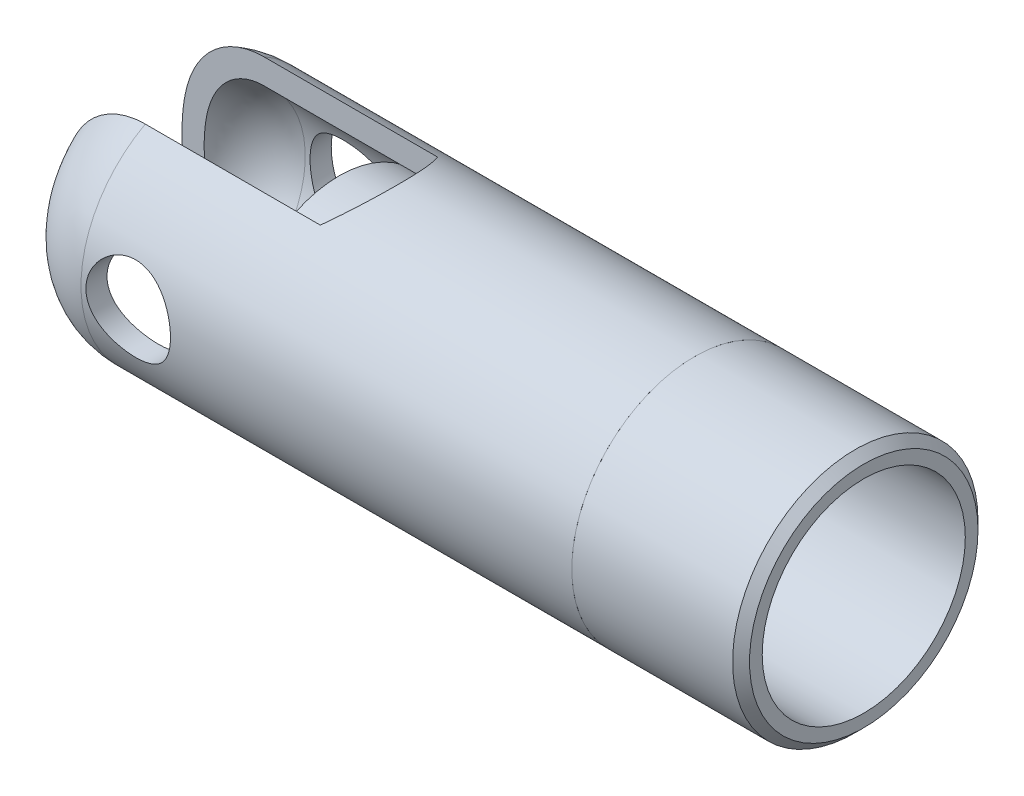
ISO-10303-21;
HEADER;
FILE_DESCRIPTION(('STEP AP214'),'2;1');
FILE_NAME('part.step','',(''),(''),'','','');
FILE_SCHEMA(('AUTOMOTIVE_DESIGN { 1 0 10303 214 1 1 1 1 }'));
ENDSEC;
DATA;
#1=APPLICATION_CONTEXT('core data for automotive mechanical design processes');
#2=APPLICATION_PROTOCOL_DEFINITION('international standard','automotive_design',2000,#1);
#3=PRODUCT_CONTEXT('',#1,'mechanical');
#4=PRODUCT('Part','Part','',(#3));
#5=PRODUCT_RELATED_PRODUCT_CATEGORY('part','',(#4));
#6=PRODUCT_DEFINITION_FORMATION('','',#4);
#7=PRODUCT_DEFINITION_CONTEXT('part definition',#1,'design');
#8=PRODUCT_DEFINITION('design','',#6,#7);
#9=PRODUCT_DEFINITION_SHAPE('','',#8);
#10=(LENGTH_UNIT() NAMED_UNIT(*) SI_UNIT(.MILLI.,.METRE.));
#11=(NAMED_UNIT(*) PLANE_ANGLE_UNIT() SI_UNIT($,.RADIAN.));
#12=(NAMED_UNIT(*) SI_UNIT($,.STERADIAN.) SOLID_ANGLE_UNIT());
#13=UNCERTAINTY_MEASURE_WITH_UNIT(LENGTH_MEASURE(1.E-05),#10,'distance_accuracy_value','');
#14=(GEOMETRIC_REPRESENTATION_CONTEXT(3) GLOBAL_UNCERTAINTY_ASSIGNED_CONTEXT((#13)) GLOBAL_UNIT_ASSIGNED_CONTEXT((#10,
#11,#12)) REPRESENTATION_CONTEXT('',''));
#15=CARTESIAN_POINT('',(0.,0.,0.));
#16=DIRECTION('',(0.,0.,1.));
#17=DIRECTION('',(1.,0.,0.));
#18=AXIS2_PLACEMENT_3D('',#15,#16,#17);
#19=CARTESIAN_POINT('',(-39.,0.,0.));
#20=DIRECTION('',(-1.,0.,0.));
#21=DIRECTION('',(0.,0.,1.));
#22=AXIS2_PLACEMENT_3D('',#19,#20,#21);
#23=DEGENERATE_TOROIDAL_SURFACE('',#22,2.25,5.,.T.);
#24=CARTESIAN_POINT('',(-43.8291760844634,0.,-3.54578483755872));
#25=CARTESIAN_POINT('',(-43.8291762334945,-0.11585127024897,-3.54578483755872));
#26=CARTESIAN_POINT('',(-43.8276604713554,-0.231702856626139,-3.54578483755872));
#27=CARTESIAN_POINT('',(-43.8215107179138,-0.463318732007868,-3.54578483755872));
#28=CARTESIAN_POINT('',(-43.8168767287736,-0.579083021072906,-3.54578483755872));
#29=CARTESIAN_POINT('',(-43.7979782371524,-0.926154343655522,-3.54578483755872));
#30=CARTESIAN_POINT('',(-43.7787171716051,-1.15722737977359,-3.54578483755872));
#31=CARTESIAN_POINT('',(-43.7238679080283,-1.61624128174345,-3.54578483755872));
#32=CARTESIAN_POINT('',(-43.6883675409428,-1.84419228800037,-3.54578483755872));
#33=CARTESIAN_POINT('',(-43.5972849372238,-2.29604038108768,-3.54578483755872));
#34=CARTESIAN_POINT('',(-43.5417176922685,-2.51994036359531,-3.54578483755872));
#35=CARTESIAN_POINT('',(-43.4308389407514,-2.8835895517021,-3.54578483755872));
#36=CARTESIAN_POINT('',(-43.3822299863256,-3.02539180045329,-3.54578483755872));
#37=CARTESIAN_POINT('',(-43.2745660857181,-3.30496227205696,-3.54578483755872));
#38=CARTESIAN_POINT('',(-43.2155140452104,-3.44273160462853,-3.54578483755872));
#39=CARTESIAN_POINT('',(-43.0865162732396,-3.71320544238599,-3.54578483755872));
#40=CARTESIAN_POINT('',(-43.0165632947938,-3.8459065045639,-3.54578483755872));
#41=CARTESIAN_POINT('',(-42.8656507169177,-4.10491738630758,-3.54578483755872));
#42=CARTESIAN_POINT('',(-42.7846910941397,-4.23122719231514,-3.54578483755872));
#43=CARTESIAN_POINT('',(-42.6112271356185,-4.47710475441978,-3.54578483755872));
#44=CARTESIAN_POINT('',(-42.5186404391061,-4.59661456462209,-3.54578483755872));
#45=CARTESIAN_POINT('',(-42.3227891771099,-4.8265374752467,-3.54578483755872));
#46=CARTESIAN_POINT('',(-42.2195256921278,-4.93695149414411,-3.54578483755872));
#47=CARTESIAN_POINT('',(-42.0029368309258,-5.14741960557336,-3.54578483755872));
#48=CARTESIAN_POINT('',(-41.8896124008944,-5.24747467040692,-3.54578483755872));
#49=CARTESIAN_POINT('',(-41.6537340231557,-5.4360359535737,-3.54578483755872));
#50=CARTESIAN_POINT('',(-41.5311812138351,-5.52454359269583,-3.54578483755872));
#51=CARTESIAN_POINT('',(-41.2918904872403,-5.67984039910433,-3.54578483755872));
#52=CARTESIAN_POINT('',(-41.1760066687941,-5.74794878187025,-3.54578483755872));
#53=CARTESIAN_POINT('',(-40.9386031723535,-5.87350074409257,-3.54578483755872));
#54=CARTESIAN_POINT('',(-40.8170840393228,-5.93094535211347,-3.54578483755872));
#55=CARTESIAN_POINT('',(-40.5693935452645,-6.03457174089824,-3.54578483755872));
#56=CARTESIAN_POINT('',(-40.4432241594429,-6.08075824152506,-3.54578483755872));
#57=CARTESIAN_POINT('',(-40.1871971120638,-6.16142762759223,-3.54578483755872));
#58=CARTESIAN_POINT('',(-40.0573395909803,-6.19591095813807,-3.54578483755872));
#59=CARTESIAN_POINT('',(-39.8038127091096,-6.25091120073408,-3.54578483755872));
#60=CARTESIAN_POINT('',(-39.6803122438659,-6.27220954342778,-3.54578483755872));
#61=CARTESIAN_POINT('',(-39.4318944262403,-6.30412744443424,-3.54578483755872));
#62=CARTESIAN_POINT('',(-39.3069766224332,-6.31474349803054,-3.54578483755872));
#63=CARTESIAN_POINT('',(-39.0567505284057,-6.32518484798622,-3.54578483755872));
#64=CARTESIAN_POINT('',(-38.9314424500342,-6.32501522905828,-3.54578483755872));
#65=CARTESIAN_POINT('',(-38.6812586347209,-6.31389744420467,-3.54578483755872));
#66=CARTESIAN_POINT('',(-38.5563830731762,-6.30294532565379,-3.54578483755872));
#67=CARTESIAN_POINT('',(-38.3105227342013,-6.27068277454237,-3.54578483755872));
#68=CARTESIAN_POINT('',(-38.189510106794,-6.24958404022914,-3.54578483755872));
#69=CARTESIAN_POINT('',(-37.9496389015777,-6.19729910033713,-3.54578483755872));
#70=CARTESIAN_POINT('',(-37.8307811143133,-6.16610926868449,-3.54578483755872));
#71=CARTESIAN_POINT('',(-37.5961541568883,-6.0939341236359,-3.54578483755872));
#72=CARTESIAN_POINT('',(-37.4803832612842,-6.05295441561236,-3.54578483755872));
#73=CARTESIAN_POINT('',(-37.2525965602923,-5.96152369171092,-3.54578483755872));
#74=CARTESIAN_POINT('',(-37.1405821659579,-5.91106916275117,-3.54578483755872));
#75=CARTESIAN_POINT('',(-36.9201473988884,-5.80065759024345,-3.54578483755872));
#76=CARTESIAN_POINT('',(-36.8117656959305,-5.74062337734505,-3.54578483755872));
#77=CARTESIAN_POINT('',(-36.6002522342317,-5.61185231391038,-3.54578483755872));
#78=CARTESIAN_POINT('',(-36.4971223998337,-5.54311230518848,-3.54578483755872));
#79=CARTESIAN_POINT('',(-36.2967409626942,-5.39750441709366,-3.54578483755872));
#80=CARTESIAN_POINT('',(-36.1994906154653,-5.32063481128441,-3.54578483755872));
#81=CARTESIAN_POINT('',(-36.011381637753,-5.1593791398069,-3.54578483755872));
#82=CARTESIAN_POINT('',(-35.9205253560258,-5.07499033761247,-3.54578483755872));
#83=CARTESIAN_POINT('',(-35.7420927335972,-4.89579463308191,-3.54578483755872));
#84=CARTESIAN_POINT('',(-35.6548026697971,-4.80070275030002,-3.54578483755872));
#85=CARTESIAN_POINT('',(-35.4880161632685,-4.60391070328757,-3.54578483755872));
#86=CARTESIAN_POINT('',(-35.4085204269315,-4.50220994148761,-3.54578483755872));
#87=CARTESIAN_POINT('',(-35.2576810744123,-4.29317278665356,-3.54578483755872));
#88=CARTESIAN_POINT('',(-35.186325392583,-4.18584508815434,-3.54578483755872));
#89=CARTESIAN_POINT('',(-35.051742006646,-3.96624650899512,-3.54578483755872));
#90=CARTESIAN_POINT('',(-34.9885133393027,-3.85397621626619,-3.54578483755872));
#91=CARTESIAN_POINT('',(-34.84817766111,-3.58282443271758,-3.54578483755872));
#92=CARTESIAN_POINT('',(-34.7746193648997,-3.42209732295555,-3.54578483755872));
#93=CARTESIAN_POINT('',(-34.6421852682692,-3.09471146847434,-3.54578483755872));
#94=CARTESIAN_POINT('',(-34.583313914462,-2.92805094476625,-3.54578483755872));
#95=CARTESIAN_POINT('',(-34.4789745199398,-2.58956148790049,-3.54578483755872));
#96=CARTESIAN_POINT('',(-34.4335866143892,-2.41770808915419,-3.54578483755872));
#97=CARTESIAN_POINT('',(-34.3552673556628,-2.07124114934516,-3.54578483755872));
#98=CARTESIAN_POINT('',(-34.3223352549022,-1.89662777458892,-3.54578483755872));
#99=CARTESIAN_POINT('',(-34.2698065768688,-1.56203165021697,-3.54578483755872));
#100=CARTESIAN_POINT('',(-34.2492561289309,-1.40219477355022,-3.54578483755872));
#101=CARTESIAN_POINT('',(-34.2157660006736,-1.08172110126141,-3.54578483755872));
#102=CARTESIAN_POINT('',(-34.2028273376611,-0.921084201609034,-3.54578483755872));
#103=CARTESIAN_POINT('',(-34.1835000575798,-0.599160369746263,-3.54578483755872));
#104=CARTESIAN_POINT('',(-34.1771223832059,-0.437872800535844,-3.54578483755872));
#105=CARTESIAN_POINT('',(-34.1703292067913,-0.115190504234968,-3.54578483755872));
#106=CARTESIAN_POINT('',(-34.1699132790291,0.0462042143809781,-3.54578483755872));
#107=CARTESIAN_POINT('',(-34.174994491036,0.368561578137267,-3.54578483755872));
#108=CARTESIAN_POINT('',(-34.1804787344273,0.529524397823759,-3.54578483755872));
#109=CARTESIAN_POINT('',(-34.1978815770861,0.851086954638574,-3.54578483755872));
#110=CARTESIAN_POINT('',(-34.2098006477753,1.01168666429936,-3.54578483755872));
#111=CARTESIAN_POINT('',(-34.2566558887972,1.49186130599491,-3.54578483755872));
#112=CARTESIAN_POINT('',(-34.3026937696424,1.81059017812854,-3.54578483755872));
#113=CARTESIAN_POINT('',(-34.4002114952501,2.27692861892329,-3.54578483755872));
#114=CARTESIAN_POINT('',(-34.4365505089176,2.42774864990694,-3.54578483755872));
#115=CARTESIAN_POINT('',(-34.5194493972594,2.7266095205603,-3.54578483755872));
#116=CARTESIAN_POINT('',(-34.5660101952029,2.87465010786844,-3.54578483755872));
#117=CARTESIAN_POINT('',(-34.6699932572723,3.16642684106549,-3.54578483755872));
#118=CARTESIAN_POINT('',(-34.7273850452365,3.31017378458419,-3.54578483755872));
#119=CARTESIAN_POINT('',(-34.8536262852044,3.59253943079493,-3.54578483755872));
#120=CARTESIAN_POINT('',(-34.9224735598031,3.73115910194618,-3.54578483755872));
#121=CARTESIAN_POINT('',(-35.0726607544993,4.00339526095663,-3.54578483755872));
#122=CARTESIAN_POINT('',(-35.1541247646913,4.13694356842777,-3.54578483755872));
#123=CARTESIAN_POINT('',(-35.3289540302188,4.39604017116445,-3.54578483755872));
#124=CARTESIAN_POINT('',(-35.4223197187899,4.52158817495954,-3.54578483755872));
#125=CARTESIAN_POINT('',(-35.6207160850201,4.76337393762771,-3.54578483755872));
#126=CARTESIAN_POINT('',(-35.7257605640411,4.87960039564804,-3.54578483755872));
#127=CARTESIAN_POINT('',(-35.9467836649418,5.10114713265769,-3.54578483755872));
#128=CARTESIAN_POINT('',(-36.0627609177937,5.20646877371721,-3.54578483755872));
#129=CARTESIAN_POINT('',(-36.2916868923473,5.39416212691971,-3.54578483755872));
#130=CARTESIAN_POINT('',(-36.4036125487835,5.47778393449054,-3.54578483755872));
#131=CARTESIAN_POINT('',(-36.6346559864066,5.63441584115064,-3.54578483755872));
#132=CARTESIAN_POINT('',(-36.7537730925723,5.70742693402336,-3.54578483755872));
#133=CARTESIAN_POINT('',(-36.9981761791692,5.84200338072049,-3.54578483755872));
#134=CARTESIAN_POINT('',(-37.1234567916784,5.90357847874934,-3.54578483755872));
#135=CARTESIAN_POINT('',(-37.3792470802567,6.0146898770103,-3.54578483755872));
#136=CARTESIAN_POINT('',(-37.5097564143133,6.06422696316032,-3.54578483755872));
#137=CARTESIAN_POINT('',(-37.7629533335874,6.14683093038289,-3.54578483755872));
#138=CARTESIAN_POINT('',(-37.8852897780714,6.18097790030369,-3.54578483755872));
#139=CARTESIAN_POINT('',(-38.1325066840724,6.23855035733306,-3.54578483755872));
#140=CARTESIAN_POINT('',(-38.2573879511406,6.26197239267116,-3.54578483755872));
#141=CARTESIAN_POINT('',(-38.5086541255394,6.29785107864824,-3.54578483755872));
#142=CARTESIAN_POINT('',(-38.6350382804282,6.31031300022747,-3.54578483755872));
#143=CARTESIAN_POINT('',(-38.8884596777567,6.32417760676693,-3.54578483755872));
#144=CARTESIAN_POINT('',(-39.0154971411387,6.32557626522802,-3.54578483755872));
#145=CARTESIAN_POINT('',(-39.2653103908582,6.31741854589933,-3.54578483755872));
#146=CARTESIAN_POINT('',(-39.3880972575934,6.30819723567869,-3.54578483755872));
#147=CARTESIAN_POINT('',(-39.6324986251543,6.27941848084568,-3.54578483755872));
#148=CARTESIAN_POINT('',(-39.7541126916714,6.25985734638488,-3.54578483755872));
#149=CARTESIAN_POINT('',(-39.9952049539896,6.21057880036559,-3.54578483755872));
#150=CARTESIAN_POINT('',(-40.1146841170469,6.18086611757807,-3.54578483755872));
#151=CARTESIAN_POINT('',(-40.3507747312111,6.1115279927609,-3.54578483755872));
#152=CARTESIAN_POINT('',(-40.4673851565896,6.07189906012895,-3.54578483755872));
#153=CARTESIAN_POINT('',(-40.697023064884,5.98302785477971,-3.54578483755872));
#154=CARTESIAN_POINT('',(-40.8100466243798,5.93377545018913,-3.54578483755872));
#155=CARTESIAN_POINT('',(-41.0316400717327,5.8261032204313,-3.54578483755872));
#156=CARTESIAN_POINT('',(-41.1402098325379,5.76768313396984,-3.54578483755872));
#157=CARTESIAN_POINT('',(-41.3522289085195,5.64215730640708,-3.54578483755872));
#158=CARTESIAN_POINT('',(-41.4556773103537,5.57505002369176,-3.54578483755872));
#159=CARTESIAN_POINT('',(-41.6567935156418,5.43273457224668,-3.54578483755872));
#160=CARTESIAN_POINT('',(-41.7544629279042,5.3575286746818,-3.54578483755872));
#161=CARTESIAN_POINT('',(-41.9464109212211,5.19719838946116,-3.54578483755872));
#162=CARTESIAN_POINT('',(-42.0404951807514,5.11184142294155,-3.54578483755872));
#163=CARTESIAN_POINT('',(-42.2214946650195,4.93389488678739,-3.54578483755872));
#164=CARTESIAN_POINT('',(-42.3084118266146,4.84130728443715,-3.54578483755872));
#165=CARTESIAN_POINT('',(-42.4747681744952,4.64959731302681,-3.54578483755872));
#166=CARTESIAN_POINT('',(-42.5542049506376,4.55047285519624,-3.54578483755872));
#167=CARTESIAN_POINT('',(-42.7053038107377,4.34651327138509,-3.54578483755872));
#168=CARTESIAN_POINT('',(-42.7769677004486,4.24167948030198,-3.54578483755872));
#169=CARTESIAN_POINT('',(-42.9175832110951,4.01887419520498,-3.54578483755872));
#170=CARTESIAN_POINT('',(-42.9859126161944,3.90051020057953,-3.54578483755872));
#171=CARTESIAN_POINT('',(-43.1134704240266,3.65898657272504,-3.54578483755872));
#172=CARTESIAN_POINT('',(-43.1726983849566,3.53582670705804,-3.54578483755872));
#173=CARTESIAN_POINT('',(-43.2822225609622,3.28567355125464,-3.54578483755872));
#174=CARTESIAN_POINT('',(-43.3325226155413,3.15868193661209,-3.54578483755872));
#175=CARTESIAN_POINT('',(-43.4245997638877,2.90163585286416,-3.54578483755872));
#176=CARTESIAN_POINT('',(-43.4663748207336,2.77158066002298,-3.54578483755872));
#177=CARTESIAN_POINT('',(-43.5654707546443,2.42730440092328,-3.54578483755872));
#178=CARTESIAN_POINT('',(-43.6162355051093,2.21118394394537,-3.54578483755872));
#179=CARTESIAN_POINT('',(-43.6995763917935,1.7754548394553,-3.54578483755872));
#180=CARTESIAN_POINT('',(-43.7321399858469,1.55584389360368,-3.54578483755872));
#181=CARTESIAN_POINT('',(-43.7825556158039,1.11381332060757,-3.54578483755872));
#182=CARTESIAN_POINT('',(-43.8003287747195,0.891384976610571,-3.54578483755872));
#183=CARTESIAN_POINT('',(-43.817791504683,0.557327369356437,-3.54578483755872));
#184=CARTESIAN_POINT('',(-43.8220795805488,0.445905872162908,-3.54578483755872));
#185=CARTESIAN_POINT('',(-43.8277717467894,0.222989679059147,-3.54578483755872));
#186=CARTESIAN_POINT('',(-43.8291759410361,0.111494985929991,-3.54578483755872));
#187=CARTESIAN_POINT('',(-43.8291760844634,0.,-3.54578483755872));
#188=B_SPLINE_CURVE_WITH_KNOTS('',3,(#24,#25,#26,#27,#28,#29,#30,#31,#32,#33,#34,#35,#36,#37,
#38,#39,#40,#41,#42,#43,#44,#45,#46,#47,#48,#49,#50,#51,#52,#53,#54,#55,#56,#57,#58,#59,#60,#61,
#62,#63,#64,#65,#66,#67,#68,#69,#70,#71,#72,#73,#74,#75,#76,#77,#78,#79,#80,#81,#82,#83,#84,#85,
#86,#87,#88,#89,#90,#91,#92,#93,#94,#95,#96,#97,#98,#99,#100,#101,#102,#103,#104,#105,#106,#107,
#108,#109,#110,#111,#112,#113,#114,#115,#116,#117,#118,#119,#120,#121,#122,#123,#124,#125,#126,
#127,#128,#129,#130,#131,#132,#133,#134,#135,#136,#137,#138,#139,#140,#141,#142,#143,#144,#145,
#146,#147,#148,#149,#150,#151,#152,#153,#154,#155,#156,#157,#158,#159,#160,#161,#162,#163,#164,
#165,#166,#167,#168,#169,#170,#171,#172,#173,#174,#175,#176,#177,#178,#179,#180,#181,#182,#183,
#184,#185,#186,#187),.UNSPECIFIED.,.T.,.F.,(4,2,2,2,2,2,2,2,2,2,2,2,2,2,2,2,2,2,2,2,2,2,2,2,2,2,
2,2,2,2,2,2,2,2,2,2,2,2,2,2,2,2,2,2,2,2,2,2,2,2,2,2,2,2,2,2,2,2,2,2,2,2,2,2,2,2,2,2,2,2,2,2,2,2,
2,2,2,2,2,2,2,4),(0.,0.347541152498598,0.695082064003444,1.39020119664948,2.08160440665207,
2.77249214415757,3.22183620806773,3.67105544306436,4.12057460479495,4.57009472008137,
5.0230005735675,5.4758606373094,5.92867815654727,6.38143990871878,6.78416629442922,
7.18685381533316,7.58937222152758,7.99187531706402,8.36739018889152,8.74302822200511,
9.11848916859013,9.49408780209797,9.8621692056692,10.2303830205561,10.5983865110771,
10.9665267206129,11.3377979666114,11.709204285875,12.0806896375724,12.4523107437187,
12.8391360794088,13.225996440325,13.6122757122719,13.9985091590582,14.5279735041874,
15.0575979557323,15.5903098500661,16.1229897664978,16.6062414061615,17.0895576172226,
17.573678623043,18.0577650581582,18.5407955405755,19.0238614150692,19.9876640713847,
20.452782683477,20.9179433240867,21.3818141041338,21.8455968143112,22.3142705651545,
22.7829613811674,23.2522120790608,23.7214040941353,24.1399790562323,24.5585147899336,
24.9766922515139,25.394842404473,25.7754132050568,26.1561064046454,26.5366164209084,
26.9172649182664,27.286225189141,27.6553172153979,28.0242375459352,28.3932879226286,
28.762728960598,29.1321805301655,29.5016977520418,29.8711116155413,30.2517943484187,
30.6323738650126,31.0130755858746,31.3936886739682,31.803288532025,32.2129082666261,
32.6223514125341,33.0318922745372,33.6968804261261,34.3623262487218,35.0312985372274,
35.3657833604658,35.7002561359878),.UNSPECIFIED.);
#189=CARTESIAN_POINT('',(-39.,6.32375757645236,-3.54578483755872));
#190=VERTEX_POINT('',#189);
#191=CARTESIAN_POINT('',(-39.,-6.32375757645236,-3.54578483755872));
#192=VERTEX_POINT('',#191);
#193=EDGE_CURVE('E153',#190,#192,#188,.T.);
#194=ORIENTED_EDGE('',*,*,#193,.F.);
#195=CARTESIAN_POINT('',(-39.,0.,0.));
#196=DIRECTION('',(-1.,0.,0.));
#197=DIRECTION('',(0.,0.,1.));
#198=AXIS2_PLACEMENT_3D('',#195,#196,#197);
#199=CIRCLE('',#198,7.25);
#200=EDGE_CURVE('E270',#192,#190,#199,.F.);
#201=ORIENTED_EDGE('',*,*,#200,.F.);
#202=EDGE_LOOP('',(#194,#201));
#203=FACE_BOUND('',#202,.T.);
#204=ADVANCED_FACE('F46',(#203),#23,.T.);
#205=CARTESIAN_POINT('',(-39.,0.,0.));
#206=DIRECTION('',(-1.,0.,0.));
#207=DIRECTION('',(0.,0.,1.));
#208=AXIS2_PLACEMENT_3D('',#205,#206,#207);
#209=DEGENERATE_TOROIDAL_SURFACE('',#208,2.25,3.75,.T.);
#210=CARTESIAN_POINT('',(-39.,0.,0.));
#211=DIRECTION('',(1.,0.,0.));
#212=DIRECTION('',(0.,0.,-1.));
#213=AXIS2_PLACEMENT_3D('',#210,#211,#212);
#214=CIRCLE('',#213,6.);
#215=CARTESIAN_POINT('',(-39.,-4.84018696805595,-3.54578483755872));
#216=VERTEX_POINT('',#215);
#217=CARTESIAN_POINT('',(-39.,4.84018696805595,-3.54578483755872));
#218=VERTEX_POINT('',#217);
#219=EDGE_CURVE('E262',#216,#218,#214,.T.);
#220=ORIENTED_EDGE('',*,*,#219,.T.);
#221=CARTESIAN_POINT('',(-42.519011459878,0.,-3.54578483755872));
#222=CARTESIAN_POINT('',(-42.5190102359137,-0.110607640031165,-3.54578483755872));
#223=CARTESIAN_POINT('',(-42.5171135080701,-0.221212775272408,-3.54578483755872));
#224=CARTESIAN_POINT('',(-42.5094271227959,-0.442296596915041,-3.54578483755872));
#225=CARTESIAN_POINT('',(-42.5036372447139,-0.552775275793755,-3.54578483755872));
#226=CARTESIAN_POINT('',(-42.4878819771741,-0.773514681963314,-3.54578483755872));
#227=CARTESIAN_POINT('',(-42.4779138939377,-0.883775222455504,-3.54578483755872));
#228=CARTESIAN_POINT('',(-42.4533732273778,-1.10378127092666,-3.54578483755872));
#229=CARTESIAN_POINT('',(-42.4388003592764,-1.21352674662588,-3.54578483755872));
#230=CARTESIAN_POINT('',(-42.3875830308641,-1.54025086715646,-3.54578483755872));
#231=CARTESIAN_POINT('',(-42.3433514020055,-1.75614074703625,-3.54578483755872));
#232=CARTESIAN_POINT('',(-42.2300153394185,-2.18104032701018,-3.54578483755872));
#233=CARTESIAN_POINT('',(-42.1609567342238,-2.39006193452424,-3.54578483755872));
#234=CARTESIAN_POINT('',(-41.9979153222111,-2.78661747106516,-3.54578483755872));
#235=CARTESIAN_POINT('',(-41.9053138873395,-2.97470224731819,-3.54578483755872));
#236=CARTESIAN_POINT('',(-41.7454879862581,-3.24438226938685,-3.54578483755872));
#237=CARTESIAN_POINT('',(-41.6886898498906,-3.33224420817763,-3.54578483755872));
#238=CARTESIAN_POINT('',(-41.5680918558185,-3.50300451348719,-3.54578483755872));
#239=CARTESIAN_POINT('',(-41.5042949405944,-3.5859049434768,-3.54578483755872));
#240=CARTESIAN_POINT('',(-41.3692481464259,-3.74655644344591,-3.54578483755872));
#241=CARTESIAN_POINT('',(-41.2979421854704,-3.82426046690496,-3.54578483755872));
#242=CARTESIAN_POINT('',(-41.148615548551,-3.9728655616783,-3.54578483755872));
#243=CARTESIAN_POINT('',(-41.070598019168,-4.04376978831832,-3.54578483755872));
#244=CARTESIAN_POINT('',(-40.9082322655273,-4.17795935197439,-3.54578483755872));
#245=CARTESIAN_POINT('',(-40.8238835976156,-4.24124415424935,-3.54578483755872));
#246=CARTESIAN_POINT('',(-40.6495002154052,-4.35935306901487,-3.54578483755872));
#247=CARTESIAN_POINT('',(-40.5594661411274,-4.414178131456,-3.54578483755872));
#248=CARTESIAN_POINT('',(-40.2994141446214,-4.55530007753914,-3.54578483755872));
#249=CARTESIAN_POINT('',(-40.1235800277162,-4.63120607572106,-3.54578483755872));
#250=CARTESIAN_POINT('',(-39.7610409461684,-4.74920004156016,-3.54578483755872));
#251=CARTESIAN_POINT('',(-39.574342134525,-4.79130695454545,-3.54578483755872));
#252=CARTESIAN_POINT('',(-39.2126243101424,-4.83771843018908,-3.54578483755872));
#253=CARTESIAN_POINT('',(-39.0379786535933,-4.8449580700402,-3.54578483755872));
#254=CARTESIAN_POINT('',(-38.6900687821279,-4.82930117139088,-3.54578483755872));
#255=CARTESIAN_POINT('',(-38.5168042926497,-4.80641078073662,-3.54578483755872));
#256=CARTESIAN_POINT('',(-38.1804114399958,-4.73226137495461,-3.54578483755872));
#257=CARTESIAN_POINT('',(-38.0171451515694,-4.68162385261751,-3.54578483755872));
#258=CARTESIAN_POINT('',(-37.7011254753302,-4.55437875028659,-3.54578483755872));
#259=CARTESIAN_POINT('',(-37.5483713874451,-4.47777290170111,-3.54578483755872));
#260=CARTESIAN_POINT('',(-37.2528775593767,-4.29893336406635,-3.54578483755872));
#261=CARTESIAN_POINT('',(-37.1105351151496,-4.19604545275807,-3.54578483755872));
#262=CARTESIAN_POINT('',(-36.8434959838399,-3.96945662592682,-3.54578483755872));
#263=CARTESIAN_POINT('',(-36.7188097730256,-3.84574344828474,-3.54578483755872));
#264=CARTESIAN_POINT('',(-36.4792903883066,-3.57064270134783,-3.54578483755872));
#265=CARTESIAN_POINT('',(-36.3661208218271,-3.41781352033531,-3.54578483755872));
#266=CARTESIAN_POINT('',(-36.1630600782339,-3.09775387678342,-3.54578483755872));
#267=CARTESIAN_POINT('',(-36.0731476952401,-2.93053671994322,-3.54578483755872));
#268=CARTESIAN_POINT('',(-35.9321344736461,-2.62272072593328,-3.54578483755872));
#269=CARTESIAN_POINT('',(-35.8768465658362,-2.48399706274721,-3.54578483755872));
#270=CARTESIAN_POINT('',(-35.7788786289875,-2.20215445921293,-3.54578483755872));
#271=CARTESIAN_POINT('',(-35.7362022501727,-2.05903425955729,-3.54578483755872));
#272=CARTESIAN_POINT('',(-35.6618975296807,-1.76896426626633,-3.54578483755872));
#273=CARTESIAN_POINT('',(-35.630346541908,-1.62199500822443,-3.54578483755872));
#274=CARTESIAN_POINT('',(-35.5772004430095,-1.32630606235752,-3.54578483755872));
#275=CARTESIAN_POINT('',(-35.555604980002,-1.17758643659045,-3.54578483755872));
#276=CARTESIAN_POINT('',(-35.5236492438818,-0.902164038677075,-3.54578483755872));
#277=CARTESIAN_POINT('',(-35.5120708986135,-0.775597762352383,-3.54578483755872));
#278=CARTESIAN_POINT('',(-35.4943906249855,-0.522072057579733,-3.54578483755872));
#279=CARTESIAN_POINT('',(-35.4882893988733,-0.395112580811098,-3.54578483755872));
#280=CARTESIAN_POINT('',(-35.4811690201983,-0.140891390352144,-3.54578483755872));
#281=CARTESIAN_POINT('',(-35.4801564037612,-0.0136294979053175,-3.54578483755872));
#282=CARTESIAN_POINT('',(-35.4831615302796,0.240826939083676,-3.54578483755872));
#283=CARTESIAN_POINT('',(-35.4871789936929,0.368021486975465,-3.54578483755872));
#284=CARTESIAN_POINT('',(-35.5004800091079,0.6215273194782,-3.54578483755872));
#285=CARTESIAN_POINT('',(-35.5097377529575,0.74783988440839,-3.54578483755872));
#286=CARTESIAN_POINT('',(-35.53404764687,0.99989330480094,-3.54578483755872));
#287=CARTESIAN_POINT('',(-35.5491003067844,1.12563410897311,-3.54578483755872));
#288=CARTESIAN_POINT('',(-35.6040409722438,1.50100320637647,-3.54578483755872));
#289=CARTESIAN_POINT('',(-35.6537377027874,1.74941463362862,-3.54578483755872));
#290=CARTESIAN_POINT('',(-35.7494588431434,2.10190667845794,-3.54578483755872));
#291=CARTESIAN_POINT('',(-35.7822449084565,2.20965393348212,-3.54578483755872));
#292=CARTESIAN_POINT('',(-35.8549662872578,2.42274425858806,-3.54578483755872));
#293=CARTESIAN_POINT('',(-35.8949018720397,2.5280872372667,-3.54578483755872));
#294=CARTESIAN_POINT('',(-35.982331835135,2.73543886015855,-3.54578483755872));
#295=CARTESIAN_POINT('',(-36.0298161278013,2.83745173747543,-3.54578483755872));
#296=CARTESIAN_POINT('',(-36.1327108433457,3.03739380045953,-3.54578483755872));
#297=CARTESIAN_POINT('',(-36.1881197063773,3.13532378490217,-3.54578483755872));
#298=CARTESIAN_POINT('',(-36.307695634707,3.32719210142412,-3.54578483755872));
#299=CARTESIAN_POINT('',(-36.3719516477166,3.42107523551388,-3.54578483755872));
#300=CARTESIAN_POINT('',(-36.5087030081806,3.60257882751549,-3.54578483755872));
#301=CARTESIAN_POINT('',(-36.5811939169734,3.69020261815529,-3.54578483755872));
#302=CARTESIAN_POINT('',(-36.7342737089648,3.85819718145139,-3.54578483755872));
#303=CARTESIAN_POINT('',(-36.8148681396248,3.93856291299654,-3.54578483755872));
#304=CARTESIAN_POINT('',(-36.9836681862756,4.09086341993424,-3.54578483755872));
#305=CARTESIAN_POINT('',(-37.0718726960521,4.16279941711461,-3.54578483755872));
#306=CARTESIAN_POINT('',(-37.2452812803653,4.2898948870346,-3.54578483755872));
#307=CARTESIAN_POINT('',(-37.3297727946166,4.34602774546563,-3.54578483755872));
#308=CARTESIAN_POINT('',(-37.5036717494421,4.45006607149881,-3.54578483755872));
#309=CARTESIAN_POINT('',(-37.5930785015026,4.49797268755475,-3.54578483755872));
#310=CARTESIAN_POINT('',(-37.7760352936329,4.58491580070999,-3.54578483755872));
#311=CARTESIAN_POINT('',(-37.8695821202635,4.62395903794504,-3.54578483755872));
#312=CARTESIAN_POINT('',(-38.0600115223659,4.69270061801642,-3.54578483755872));
#313=CARTESIAN_POINT('',(-38.1568937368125,4.72239996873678,-3.54578483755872));
#314=CARTESIAN_POINT('',(-38.4275787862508,4.79085763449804,-3.54578483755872));
#315=CARTESIAN_POINT('',(-38.604077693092,4.81944689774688,-3.54578483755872));
#316=CARTESIAN_POINT('',(-38.959230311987,4.84514944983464,-3.54578483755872));
#317=CARTESIAN_POINT('',(-39.1378833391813,4.84227249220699,-3.54578483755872));
#318=CARTESIAN_POINT('',(-39.484545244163,4.80601534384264,-3.54578483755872));
#319=CARTESIAN_POINT('',(-39.6526880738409,4.77390669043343,-3.54578483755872));
#320=CARTESIAN_POINT('',(-39.9812697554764,4.68222664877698,-3.54578483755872));
#321=CARTESIAN_POINT('',(-40.1417091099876,4.62265705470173,-3.54578483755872));
#322=CARTESIAN_POINT('',(-40.452627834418,4.47745788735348,-3.54578483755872));
#323=CARTESIAN_POINT('',(-40.6029650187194,4.39152495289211,-3.54578483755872));
#324=CARTESIAN_POINT('',(-40.8881482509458,4.19702247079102,-3.54578483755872));
#325=CARTESIAN_POINT('',(-41.0229915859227,4.08844896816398,-3.54578483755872));
#326=CARTESIAN_POINT('',(-41.2826654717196,3.84500712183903,-3.54578483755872));
#327=CARTESIAN_POINT('',(-41.4063517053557,3.70892337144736,-3.54578483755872));
#328=CARTESIAN_POINT('',(-41.6322220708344,3.41997984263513,-3.54578483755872));
#329=CARTESIAN_POINT('',(-41.7343972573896,3.26711312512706,-3.54578483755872));
#330=CARTESIAN_POINT('',(-41.8919685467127,2.99312802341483,-3.54578483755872));
#331=CARTESIAN_POINT('',(-41.9524912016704,2.87489831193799,-3.54578483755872));
#332=CARTESIAN_POINT('',(-42.0627711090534,2.63350083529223,-3.54578483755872));
#333=CARTESIAN_POINT('',(-42.1125241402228,2.51033115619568,-3.54578483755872));
#334=CARTESIAN_POINT('',(-42.2466921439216,2.13524249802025,-3.54578483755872));
#335=CARTESIAN_POINT('',(-42.3159687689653,1.87782961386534,-3.54578483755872));
#336=CARTESIAN_POINT('',(-42.3957597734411,1.48477616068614,-3.54578483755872));
#337=CARTESIAN_POINT('',(-42.4184330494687,1.35129036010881,-3.54578483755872));
#338=CARTESIAN_POINT('',(-42.456381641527,1.08324035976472,-3.54578483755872));
#339=CARTESIAN_POINT('',(-42.4716569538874,0.948676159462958,-3.54578483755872));
#340=CARTESIAN_POINT('',(-42.4957350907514,0.678563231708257,-3.54578483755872));
#341=CARTESIAN_POINT('',(-42.5045170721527,0.543012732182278,-3.54578483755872));
#342=CARTESIAN_POINT('',(-42.516156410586,0.271640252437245,-3.54578483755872));
#343=CARTESIAN_POINT('',(-42.5190129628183,0.13581823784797,-3.54578483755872));
#344=CARTESIAN_POINT('',(-42.519011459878,0.,-3.54578483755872));
#345=B_SPLINE_CURVE_WITH_KNOTS('',3,(#221,#222,#223,#224,#225,#226,#227,#228,#229,#230,#231,
#232,#233,#234,#235,#236,#237,#238,#239,#240,#241,#242,#243,#244,#245,#246,#247,#248,#249,#250,
#251,#252,#253,#254,#255,#256,#257,#258,#259,#260,#261,#262,#263,#264,#265,#266,#267,#268,#269,
#270,#271,#272,#273,#274,#275,#276,#277,#278,#279,#280,#281,#282,#283,#284,#285,#286,#287,#288,
#289,#290,#291,#292,#293,#294,#295,#296,#297,#298,#299,#300,#301,#302,#303,#304,#305,#306,#307,
#308,#309,#310,#311,#312,#313,#314,#315,#316,#317,#318,#319,#320,#321,#322,#323,#324,#325,#326,
#327,#328,#329,#330,#331,#332,#333,#334,#335,#336,#337,#338,#339,#340,#341,#342,#343,#344),
.UNSPECIFIED.,.T.,.F.,(4,2,2,2,2,2,2,2,2,2,2,2,2,2,2,2,2,2,2,2,2,2,2,2,2,2,2,2,2,2,2,2,2,2,2,2,
2,2,2,2,2,2,2,2,2,2,2,2,2,2,2,2,2,2,2,2,2,2,2,2,2,4),(0.,0.331801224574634,0.663621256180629,
0.995655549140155,1.32771038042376,1.98755571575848,2.64618923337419,3.2726687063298,
3.58623993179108,3.89967982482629,4.2156536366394,4.5314801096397,4.84732873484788,
5.16314186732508,5.73428014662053,6.3050980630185,6.82690971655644,7.34861491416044,
7.8590859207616,8.36952289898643,8.89417325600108,9.41913361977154,9.98743920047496,
10.5552247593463,11.0026032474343,11.4501110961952,11.9006717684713,12.3512165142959,
12.7323762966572,13.1135849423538,13.4952831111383,13.8769600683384,14.2567734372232,
14.636620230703,15.3944097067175,15.7320877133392,16.0697785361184,16.4070219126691,
16.7441989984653,17.0850542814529,17.4257267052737,17.7666339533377,18.1074917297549,
18.411371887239,18.7152095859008,19.0188154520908,19.3223885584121,19.855829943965,
20.3891059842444,20.9002389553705,21.4113385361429,21.9285551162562,22.4458621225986,
22.9953424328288,23.5450507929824,23.9429724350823,24.3410497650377,25.1374943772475,
25.5435690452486,25.9496439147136,26.3570166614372,26.7644447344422),.UNSPECIFIED.);
#346=EDGE_CURVE('E173',#218,#216,#345,.T.);
#347=ORIENTED_EDGE('',*,*,#346,.T.);
#348=EDGE_LOOP('',(#220,#347));
#349=FACE_BOUND('',#348,.T.);
#350=ADVANCED_FACE('F192',(#349),#209,.F.);
#351=CARTESIAN_POINT('',(-44.,0.,0.));
#352=DIRECTION('',(1.,0.,0.));
#353=DIRECTION('',(0.,0.,-1.));
#354=AXIS2_PLACEMENT_3D('',#351,#352,#353);
#355=CYLINDRICAL_SURFACE('',#354,7.25);
#356=CARTESIAN_POINT('',(-38.7151434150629,0.,-7.25));
#357=CARTESIAN_POINT('',(-38.7151450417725,-0.136138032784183,-7.25000111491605));
#358=CARTESIAN_POINT('',(-38.7039874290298,-0.272264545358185,-7.24613062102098));
#359=CARTESIAN_POINT('',(-38.659799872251,-0.540491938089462,-7.23107307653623));
#360=CARTESIAN_POINT('',(-38.6267691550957,-0.672592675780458,-7.21988576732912));
#361=CARTESIAN_POINT('',(-38.540113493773,-0.928862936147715,-7.19140632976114));
#362=CARTESIAN_POINT('',(-38.4865244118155,-1.05304583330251,-7.17412483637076));
#363=CARTESIAN_POINT('',(-38.3604407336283,-1.29065906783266,-7.13520943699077));
#364=CARTESIAN_POINT('',(-38.2879420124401,-1.40408705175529,-7.11357458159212));
#365=CARTESIAN_POINT('',(-38.123302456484,-1.62113955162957,-7.06732869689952));
#366=CARTESIAN_POINT('',(-38.0305904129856,-1.72431473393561,-7.04264280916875));
#367=CARTESIAN_POINT('',(-37.8293697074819,-1.91400096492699,-6.99347698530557));
#368=CARTESIAN_POINT('',(-37.7208572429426,-2.00050799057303,-6.9689971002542));
#369=CARTESIAN_POINT('',(-37.486979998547,-2.1570431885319,-6.92217907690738));
#370=CARTESIAN_POINT('',(-37.3611954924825,-2.22647395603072,-6.89993143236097));
#371=CARTESIAN_POINT('',(-37.0988443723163,-2.34300113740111,-6.86124211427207));
#372=CARTESIAN_POINT('',(-36.9622813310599,-2.39010491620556,-6.84479852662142));
#373=CARTESIAN_POINT('',(-36.6873786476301,-2.45893167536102,-6.82037051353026));
#374=CARTESIAN_POINT('',(-36.5492766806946,-2.48150110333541,-6.81210492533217));
#375=CARTESIAN_POINT('',(-36.2710176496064,-2.50326510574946,-6.80413926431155));
#376=CARTESIAN_POINT('',(-36.1308612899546,-2.50246751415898,-6.80443632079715));
#377=CARTESIAN_POINT('',(-35.8598236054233,-2.47817462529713,-6.81331703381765));
#378=CARTESIAN_POINT('',(-35.7288259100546,-2.45580146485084,-6.82149100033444));
#379=CARTESIAN_POINT('',(-35.4725722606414,-2.39082959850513,-6.84453136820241));
#380=CARTESIAN_POINT('',(-35.3473170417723,-2.34822831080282,-6.85939862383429));
#381=CARTESIAN_POINT('',(-35.1036248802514,-2.24330725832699,-6.89442998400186));
#382=CARTESIAN_POINT('',(-34.9853390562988,-2.18066622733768,-6.91467940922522));
#383=CARTESIAN_POINT('',(-34.7606107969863,-2.03766697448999,-6.95815970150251));
#384=CARTESIAN_POINT('',(-34.6541719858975,-1.95730335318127,-6.98139147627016));
#385=CARTESIAN_POINT('',(-34.4498773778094,-1.77581858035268,-7.02981207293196));
#386=CARTESIAN_POINT('',(-34.3528385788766,-1.67378556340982,-7.05503755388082));
#387=CARTESIAN_POINT('',(-34.1770279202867,-1.45458801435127,-7.10346797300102));
#388=CARTESIAN_POINT('',(-34.0982580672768,-1.33742182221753,-7.12667268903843));
#389=CARTESIAN_POINT('',(-33.9605012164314,-1.08945873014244,-7.16878995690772));
#390=CARTESIAN_POINT('',(-33.9017471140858,-0.958523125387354,-7.18765120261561));
#391=CARTESIAN_POINT('',(-33.8073577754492,-0.687818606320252,-7.21858213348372));
#392=CARTESIAN_POINT('',(-33.7717139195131,-0.548053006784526,-7.23065435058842));
#393=CARTESIAN_POINT('',(-33.7260367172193,-0.270561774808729,-7.24622072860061));
#394=CARTESIAN_POINT('',(-33.7149004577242,-0.13303817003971,-7.25008401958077));
#395=CARTESIAN_POINT('',(-33.7153943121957,0.141948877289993,-7.2499132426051));
#396=CARTESIAN_POINT('',(-33.7270202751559,0.279412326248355,-7.24588061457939));
#397=CARTESIAN_POINT('',(-33.7718441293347,0.545869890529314,-7.23061502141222));
#398=CARTESIAN_POINT('',(-33.8043530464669,0.674994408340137,-7.21961217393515));
#399=CARTESIAN_POINT('',(-33.889146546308,0.925894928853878,-7.19174283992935));
#400=CARTESIAN_POINT('',(-33.9414336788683,1.0476699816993,-7.17487559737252));
#401=CARTESIAN_POINT('',(-34.0658718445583,1.28412105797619,-7.13640532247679));
#402=CARTESIAN_POINT('',(-34.1385256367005,1.39851296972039,-7.11468569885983));
#403=CARTESIAN_POINT('',(-34.301050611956,1.61383313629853,-7.06895878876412));
#404=CARTESIAN_POINT('',(-34.390927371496,1.71475701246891,-7.0449507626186));
#405=CARTESIAN_POINT('',(-34.5905267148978,1.90540809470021,-6.99586216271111));
#406=CARTESIAN_POINT('',(-34.7010036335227,1.99434875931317,-6.97078641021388));
#407=CARTESIAN_POINT('',(-34.9358440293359,2.15254135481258,-6.92357584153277));
#408=CARTESIAN_POINT('',(-35.0602078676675,2.22179277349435,-6.90144110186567));
#409=CARTESIAN_POINT('',(-35.3195645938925,2.33840358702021,-6.86281002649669));
#410=CARTESIAN_POINT('',(-35.4545502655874,2.38577769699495,-6.8463099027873));
#411=CARTESIAN_POINT('',(-35.7312917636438,2.45688243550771,-6.82112009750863));
#412=CARTESIAN_POINT('',(-35.8730442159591,2.48062472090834,-6.81242656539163));
#413=CARTESIAN_POINT('',(-36.1509246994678,2.5028446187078,-6.80429236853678));
#414=CARTESIAN_POINT('',(-36.2869346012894,2.50263694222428,-6.80437020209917));
#415=CARTESIAN_POINT('',(-36.5568716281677,2.48023388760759,-6.81256771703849));
#416=CARTESIAN_POINT('',(-36.6907988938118,2.45804000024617,-6.82068685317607));
#417=CARTESIAN_POINT('',(-36.9498495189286,2.39325188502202,-6.84368172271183));
#418=CARTESIAN_POINT('',(-37.0751010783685,2.35111237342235,-6.85840648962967));
#419=CARTESIAN_POINT('',(-37.3168477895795,2.24800515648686,-6.89288864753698));
#420=CARTESIAN_POINT('',(-37.433340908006,2.18703309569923,-6.91264720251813));
#421=CARTESIAN_POINT('',(-37.6600907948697,2.04471545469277,-6.95610594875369));
#422=CARTESIAN_POINT('',(-37.7698123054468,1.96256006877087,-6.97994588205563));
#423=CARTESIAN_POINT('',(-37.9743353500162,1.78154549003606,-7.02832573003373));
#424=CARTESIAN_POINT('',(-38.0691325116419,1.68268141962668,-7.05286584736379));
#425=CARTESIAN_POINT('',(-38.245220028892,1.46597972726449,-7.10114251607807));
#426=CARTESIAN_POINT('',(-38.3257584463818,1.34751104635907,-7.1247996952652));
#427=CARTESIAN_POINT('',(-38.4657050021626,1.09792112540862,-7.16750108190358));
#428=CARTESIAN_POINT('',(-38.5251167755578,0.966802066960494,-7.18654608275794));
#429=CARTESIAN_POINT('',(-38.6197026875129,0.698488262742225,-7.21750950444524));
#430=CARTESIAN_POINT('',(-38.6553712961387,0.561485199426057,-7.22957258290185));
#431=CARTESIAN_POINT('',(-38.7030869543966,0.282982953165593,-7.24581596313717));
#432=CARTESIAN_POINT('',(-38.7151417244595,0.141485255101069,-7.24999884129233));
#433=CARTESIAN_POINT('',(-38.7151434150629,0.,-7.25));
#434=B_SPLINE_CURVE_WITH_KNOTS('',3,(#356,#357,#358,#359,#360,#361,#362,#363,#364,#365,#366,
#367,#368,#369,#370,#371,#372,#373,#374,#375,#376,#377,#378,#379,#380,#381,#382,#383,#384,#385,
#386,#387,#388,#389,#390,#391,#392,#393,#394,#395,#396,#397,#398,#399,#400,#401,#402,#403,#404,
#405,#406,#407,#408,#409,#410,#411,#412,#413,#414,#415,#416,#417,#418,#419,#420,#421,#422,#423,
#424,#425,#426,#427,#428,#429,#430,#431,#432,#433),.UNSPECIFIED.,.T.,.F.,(4,2,2,2,2,2,2,2,2,2,2,
2,2,2,2,2,2,2,2,2,2,2,2,2,2,2,2,2,2,2,2,2,2,2,2,2,2,2,4),(0.,0.40789310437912,0.815800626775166,
1.22299980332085,1.63028788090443,2.05107050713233,2.47195456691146,2.90595202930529,
3.33980623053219,3.75816422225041,4.17638195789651,4.5739594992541,4.97158779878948,
5.37594017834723,5.78041592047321,6.20759271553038,6.63481640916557,7.06685368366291,
7.49872972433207,7.91073459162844,8.32266433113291,8.72165665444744,9.1207004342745,
9.53062505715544,9.94068262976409,10.3707471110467,10.8008227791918,11.2306087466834,
11.660182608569,12.0661872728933,12.4721644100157,12.8693018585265,13.2665312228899,
13.682077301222,14.0977448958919,14.5312067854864,14.964594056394,15.3886470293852,
15.8125613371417),.UNSPECIFIED.);
#435=CARTESIAN_POINT('',(-38.7151434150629,0.,-7.25));
#436=VERTEX_POINT('',#435);
#437=EDGE_CURVE('E221',#436,#436,#434,.T.);
#438=ORIENTED_EDGE('',*,*,#437,.T.);
#439=EDGE_LOOP('',(#438));
#440=FACE_BOUND('',#439,.T.);
#441=CARTESIAN_POINT('',(-33.7151434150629,0.,7.25));
#442=CARTESIAN_POINT('',(-33.7151417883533,-0.136138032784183,7.25000111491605));
#443=CARTESIAN_POINT('',(-33.726299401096,-0.272264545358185,7.24613062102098));
#444=CARTESIAN_POINT('',(-33.7704869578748,-0.540491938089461,7.23107307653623));
#445=CARTESIAN_POINT('',(-33.8035176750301,-0.672592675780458,7.21988576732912));
#446=CARTESIAN_POINT('',(-33.8901733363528,-0.928862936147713,7.19140632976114));
#447=CARTESIAN_POINT('',(-33.9437624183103,-1.0530458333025,7.17412483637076));
#448=CARTESIAN_POINT('',(-34.0698460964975,-1.29065906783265,7.13520943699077));
#449=CARTESIAN_POINT('',(-34.1423448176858,-1.40408705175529,7.11357458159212));
#450=CARTESIAN_POINT('',(-34.3069843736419,-1.62113955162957,7.06732869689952));
#451=CARTESIAN_POINT('',(-34.3996964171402,-1.72431473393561,7.04264280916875));
#452=CARTESIAN_POINT('',(-34.6009171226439,-1.91400096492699,6.99347698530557));
#453=CARTESIAN_POINT('',(-34.7094295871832,-2.00050799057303,6.9689971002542));
#454=CARTESIAN_POINT('',(-34.9433068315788,-2.1570431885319,6.92217907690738));
#455=CARTESIAN_POINT('',(-35.0690913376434,-2.22647395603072,6.89993143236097));
#456=CARTESIAN_POINT('',(-35.3314424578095,-2.34300113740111,6.86124211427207));
#457=CARTESIAN_POINT('',(-35.4680054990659,-2.39010491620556,6.84479852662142));
#458=CARTESIAN_POINT('',(-35.7429081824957,-2.45893167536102,6.82037051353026));
#459=CARTESIAN_POINT('',(-35.8810101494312,-2.48150110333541,6.81210492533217));
#460=CARTESIAN_POINT('',(-36.1592691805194,-2.50326510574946,6.80413926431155));
#461=CARTESIAN_POINT('',(-36.2994255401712,-2.50246751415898,6.80443632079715));
#462=CARTESIAN_POINT('',(-36.5704632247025,-2.47817462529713,6.81331703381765));
#463=CARTESIAN_POINT('',(-36.7014609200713,-2.45580146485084,6.82149100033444));
#464=CARTESIAN_POINT('',(-36.9577145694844,-2.39082959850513,6.84453136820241));
#465=CARTESIAN_POINT('',(-37.0829697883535,-2.34822831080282,6.85939862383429));
#466=CARTESIAN_POINT('',(-37.3266619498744,-2.24330725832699,6.89442998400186));
#467=CARTESIAN_POINT('',(-37.444947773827,-2.18066622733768,6.91467940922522));
#468=CARTESIAN_POINT('',(-37.6696760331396,-2.03766697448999,6.95815970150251));
#469=CARTESIAN_POINT('',(-37.7761148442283,-1.95730335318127,6.98139147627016));
#470=CARTESIAN_POINT('',(-37.9804094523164,-1.77581858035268,7.02981207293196));
#471=CARTESIAN_POINT('',(-38.0774482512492,-1.67378556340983,7.05503755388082));
#472=CARTESIAN_POINT('',(-38.2532589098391,-1.45458801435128,7.10346797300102));
#473=CARTESIAN_POINT('',(-38.332028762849,-1.33742182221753,7.12667268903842));
#474=CARTESIAN_POINT('',(-38.4697856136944,-1.08945873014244,7.16878995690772));
#475=CARTESIAN_POINT('',(-38.52853971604,-0.958523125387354,7.18765120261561));
#476=CARTESIAN_POINT('',(-38.6229290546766,-0.687818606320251,7.21858213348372));
#477=CARTESIAN_POINT('',(-38.6585729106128,-0.548053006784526,7.23065435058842));
#478=CARTESIAN_POINT('',(-38.7042501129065,-0.270561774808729,7.24622072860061));
#479=CARTESIAN_POINT('',(-38.7153863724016,-0.133038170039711,7.25008401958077));
#480=CARTESIAN_POINT('',(-38.7148925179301,0.141948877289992,7.2499132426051));
#481=CARTESIAN_POINT('',(-38.7032665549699,0.279412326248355,7.24588061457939));
#482=CARTESIAN_POINT('',(-38.6584427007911,0.545869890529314,7.23061502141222));
#483=CARTESIAN_POINT('',(-38.6259337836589,0.674994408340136,7.21961217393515));
#484=CARTESIAN_POINT('',(-38.5411402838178,0.925894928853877,7.19174283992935));
#485=CARTESIAN_POINT('',(-38.4888531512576,1.0476699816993,7.17487559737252));
#486=CARTESIAN_POINT('',(-38.3644149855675,1.28412105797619,7.13640532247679));
#487=CARTESIAN_POINT('',(-38.2917611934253,1.39851296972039,7.11468569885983));
#488=CARTESIAN_POINT('',(-38.1292362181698,1.61383313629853,7.06895878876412));
#489=CARTESIAN_POINT('',(-38.0393594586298,1.71475701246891,7.0449507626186));
#490=CARTESIAN_POINT('',(-37.839760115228,1.90540809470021,6.99586216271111));
#491=CARTESIAN_POINT('',(-37.7292831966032,1.99434875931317,6.97078641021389));
#492=CARTESIAN_POINT('',(-37.4944428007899,2.15254135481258,6.92357584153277));
#493=CARTESIAN_POINT('',(-37.3700789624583,2.22179277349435,6.90144110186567));
#494=CARTESIAN_POINT('',(-37.1107222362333,2.33840358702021,6.86281002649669));
#495=CARTESIAN_POINT('',(-36.9757365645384,2.38577769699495,6.8463099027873));
#496=CARTESIAN_POINT('',(-36.6989950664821,2.45688243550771,6.82112009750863));
#497=CARTESIAN_POINT('',(-36.5572426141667,2.48062472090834,6.81242656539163));
#498=CARTESIAN_POINT('',(-36.2793621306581,2.5028446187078,6.80429236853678));
#499=CARTESIAN_POINT('',(-36.1433522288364,2.50263694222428,6.80437020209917));
#500=CARTESIAN_POINT('',(-35.8734152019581,2.48023388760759,6.81256771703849));
#501=CARTESIAN_POINT('',(-35.739487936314,2.45804000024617,6.82068685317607));
#502=CARTESIAN_POINT('',(-35.4804373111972,2.39325188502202,6.84368172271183));
#503=CARTESIAN_POINT('',(-35.3551857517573,2.35111237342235,6.85840648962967));
#504=CARTESIAN_POINT('',(-35.1134390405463,2.24800515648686,6.89288864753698));
#505=CARTESIAN_POINT('',(-34.9969459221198,2.18703309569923,6.91264720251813));
#506=CARTESIAN_POINT('',(-34.7701960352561,2.04471545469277,6.95610594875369));
#507=CARTESIAN_POINT('',(-34.660474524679,1.96256006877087,6.97994588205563));
#508=CARTESIAN_POINT('',(-34.4559514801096,1.78154549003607,7.02832573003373));
#509=CARTESIAN_POINT('',(-34.3611543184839,1.68268141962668,7.05286584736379));
#510=CARTESIAN_POINT('',(-34.1850668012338,1.46597972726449,7.10114251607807));
#511=CARTESIAN_POINT('',(-34.1045283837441,1.34751104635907,7.1247996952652));
#512=CARTESIAN_POINT('',(-33.9645818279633,1.09792112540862,7.16750108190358));
#513=CARTESIAN_POINT('',(-33.905170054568,0.966802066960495,7.18654608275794));
#514=CARTESIAN_POINT('',(-33.8105841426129,0.698488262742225,7.21750950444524));
#515=CARTESIAN_POINT('',(-33.7749155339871,0.561485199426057,7.22957258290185));
#516=CARTESIAN_POINT('',(-33.7271998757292,0.282982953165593,7.24581596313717));
#517=CARTESIAN_POINT('',(-33.7151451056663,0.141485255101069,7.24999884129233));
#518=CARTESIAN_POINT('',(-33.7151434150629,0.,7.25));
#519=B_SPLINE_CURVE_WITH_KNOTS('',3,(#441,#442,#443,#444,#445,#446,#447,#448,#449,#450,#451,
#452,#453,#454,#455,#456,#457,#458,#459,#460,#461,#462,#463,#464,#465,#466,#467,#468,#469,#470,
#471,#472,#473,#474,#475,#476,#477,#478,#479,#480,#481,#482,#483,#484,#485,#486,#487,#488,#489,
#490,#491,#492,#493,#494,#495,#496,#497,#498,#499,#500,#501,#502,#503,#504,#505,#506,#507,#508,
#509,#510,#511,#512,#513,#514,#515,#516,#517,#518),.UNSPECIFIED.,.T.,.F.,(4,2,2,2,2,2,2,2,2,2,2,
2,2,2,2,2,2,2,2,2,2,2,2,2,2,2,2,2,2,2,2,2,2,2,2,2,2,2,4),(0.,0.40789310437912,0.815800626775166,
1.22299980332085,1.63028788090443,2.05107050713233,2.47195456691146,2.90595202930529,
3.33980623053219,3.75816422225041,4.17638195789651,4.5739594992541,4.97158779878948,
5.37594017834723,5.78041592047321,6.20759271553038,6.63481640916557,7.06685368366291,
7.49872972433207,7.91073459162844,8.32266433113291,8.72165665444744,9.1207004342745,
9.53062505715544,9.94068262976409,10.3707471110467,10.8008227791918,11.2306087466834,
11.660182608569,12.0661872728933,12.4721644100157,12.8693018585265,13.2665312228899,
13.682077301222,14.0977448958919,14.5312067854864,14.964594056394,15.3886470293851,
15.8125613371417),.UNSPECIFIED.);
#520=CARTESIAN_POINT('',(-33.7151434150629,0.,7.25));
#521=VERTEX_POINT('',#520);
#522=EDGE_CURVE('E216',#521,#521,#519,.T.);
#523=ORIENTED_EDGE('',*,*,#522,.T.);
#524=EDGE_LOOP('',(#523));
#525=FACE_BOUND('',#524,.T.);
#526=CARTESIAN_POINT('',(-28.6561174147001,-6.37456587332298,3.45360824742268));
#527=CARTESIAN_POINT('',(-28.5766192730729,-6.43576240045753,3.34067178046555));
#528=CARTESIAN_POINT('',(-28.500483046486,-6.49496105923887,3.22421984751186));
#529=CARTESIAN_POINT('',(-28.3555173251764,-6.60856340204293,2.98445526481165));
#530=CARTESIAN_POINT('',(-28.2866948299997,-6.6629624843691,2.86113621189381));
#531=CARTESIAN_POINT('',(-28.1566511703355,-6.76639834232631,2.6071604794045));
#532=CARTESIAN_POINT('',(-28.0954850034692,-6.8153960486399,2.47645952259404));
#533=CARTESIAN_POINT('',(-27.9820618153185,-6.906710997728,2.20902638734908));
#534=CARTESIAN_POINT('',(-27.9298023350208,-6.94903008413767,2.07229588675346));
#535=CARTESIAN_POINT('',(-27.8346228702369,-7.02640048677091,1.79258976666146));
#536=CARTESIAN_POINT('',(-27.7917629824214,-7.06140497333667,1.64958060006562));
#537=CARTESIAN_POINT('',(-27.7165237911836,-7.12302403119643,1.35906923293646));
#538=CARTESIAN_POINT('',(-27.6841431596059,-7.14963966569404,1.21156760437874));
#539=CARTESIAN_POINT('',(-27.6305579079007,-7.19376163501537,0.913718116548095));
#540=CARTESIAN_POINT('',(-27.6093162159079,-7.21129818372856,0.763381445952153));
#541=CARTESIAN_POINT('',(-27.5782835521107,-7.23693784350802,0.460740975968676));
#542=CARTESIAN_POINT('',(-27.5684909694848,-7.2450422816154,0.308437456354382));
#543=CARTESIAN_POINT('',(-27.560988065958,-7.25125113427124,0.0198098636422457));
#544=CARTESIAN_POINT('',(-27.5620874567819,-7.25034071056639,-0.116464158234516));
#545=CARTESIAN_POINT('',(-27.5735355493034,-7.24086906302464,-0.388351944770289));
#546=CARTESIAN_POINT('',(-27.5838839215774,-7.23230811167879,-0.523965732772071));
#547=CARTESIAN_POINT('',(-27.6136695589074,-7.20770506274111,-0.793615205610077));
#548=CARTESIAN_POINT('',(-27.6331140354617,-7.1916570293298,-0.927649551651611));
#549=CARTESIAN_POINT('',(-27.6807635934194,-7.15242229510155,-1.19305512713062));
#550=CARTESIAN_POINT('',(-27.7089686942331,-7.12923557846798,-1.32442635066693));
#551=CARTESIAN_POINT('',(-27.8041927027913,-7.05118974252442,-1.70556259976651));
#552=CARTESIAN_POINT('',(-27.8827876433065,-6.98703537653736,-1.95065664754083));
#553=CARTESIAN_POINT('',(-28.0676736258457,-6.83759177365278,-2.4230927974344));
#554=CARTESIAN_POINT('',(-28.1739690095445,-6.75229922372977,-2.65043210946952));
#555=CARTESIAN_POINT('',(-28.3571038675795,-6.6073500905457,-2.98703436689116));
#556=CARTESIAN_POINT('',(-28.4256890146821,-6.55341722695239,-3.10341549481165));
#557=CARTESIAN_POINT('',(-28.5692854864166,-6.44148240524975,-3.32951414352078));
#558=CARTESIAN_POINT('',(-28.6442763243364,-6.38349351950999,-3.4392511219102));
#559=CARTESIAN_POINT('',(-28.7223130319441,-6.32375757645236,-3.54578483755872));
#560=B_SPLINE_CURVE_WITH_KNOTS('',3,(#526,#527,#528,#529,#530,#531,#532,#533,#534,#535,#536,
#537,#538,#539,#540,#541,#542,#543,#544,#545,#546,#547,#548,#549,#550,#551,#552,#553,#554,#555,
#556,#557,#558,#559),.UNSPECIFIED.,.F.,.F.,(4,2,2,2,2,2,2,2,2,2,2,2,2,2,2,2,4),(0.,
0.453167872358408,0.90676561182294,1.36345452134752,1.82001714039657,2.27941880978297,
2.73876223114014,3.19656703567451,3.65430742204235,4.06262908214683,4.47093619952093,
4.87956757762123,5.28819986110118,6.08056967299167,6.87306375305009,7.30911904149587,
7.74382851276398),.UNSPECIFIED.);
#561=CARTESIAN_POINT('',(-28.6561174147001,-6.37456587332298,3.45360824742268));
#562=VERTEX_POINT('',#561);
#563=CARTESIAN_POINT('',(-28.7223130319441,-6.32375757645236,-3.54578483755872));
#564=VERTEX_POINT('',#563);
#565=EDGE_CURVE('E120',#562,#564,#560,.T.);
#566=ORIENTED_EDGE('',*,*,#565,.T.);
#567=DIRECTION('',(1.,0.,0.));
#568=VECTOR('',#567,1.);
#569=CARTESIAN_POINT('',(-44.,-6.32375757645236,-3.54578483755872));
#570=LINE('',#569,#568);
#571=EDGE_CURVE('E159',#564,#192,#570,.F.);
#572=ORIENTED_EDGE('',*,*,#571,.T.);
#573=ORIENTED_EDGE('',*,*,#200,.T.);
#574=DIRECTION('',(1.,0.,0.));
#575=VECTOR('',#574,1.);
#576=CARTESIAN_POINT('',(-44.,6.32375757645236,-3.54578483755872));
#577=LINE('',#576,#575);
#578=CARTESIAN_POINT('',(-28.7223130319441,6.32375757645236,-3.54578483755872));
#579=VERTEX_POINT('',#578);
#580=EDGE_CURVE('E129',#190,#579,#577,.T.);
#581=ORIENTED_EDGE('',*,*,#580,.T.);
#582=CARTESIAN_POINT('',(-28.7223130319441,6.32375757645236,-3.54578483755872));
#583=CARTESIAN_POINT('',(-28.639918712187,6.38683110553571,-3.43331290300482));
#584=CARTESIAN_POINT('',(-28.5608966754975,6.44797237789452,-3.31721824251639));
#585=CARTESIAN_POINT('',(-28.4101821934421,6.56556343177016,-3.07792723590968));
#586=CARTESIAN_POINT('',(-28.3384969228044,6.62200861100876,-2.95472411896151));
#587=CARTESIAN_POINT('',(-28.2027071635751,6.72964806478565,-2.70065076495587));
#588=CARTESIAN_POINT('',(-28.1386621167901,6.78080080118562,-2.56973093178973));
#589=CARTESIAN_POINT('',(-28.0195460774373,6.87645084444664,-2.30156022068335));
#590=CARTESIAN_POINT('',(-27.9644725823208,6.92095000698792,-2.16431112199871));
#591=CARTESIAN_POINT('',(-27.8637354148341,7.00268132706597,-1.88321791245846));
#592=CARTESIAN_POINT('',(-27.8181340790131,7.03986526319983,-1.73933728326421));
#593=CARTESIAN_POINT('',(-27.7375579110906,7.1057661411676,-1.44674372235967));
#594=CARTESIAN_POINT('',(-27.7025816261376,7.1344842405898,-1.29803145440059));
#595=CARTESIAN_POINT('',(-27.6440168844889,7.18266427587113,-0.997455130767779));
#596=CARTESIAN_POINT('',(-27.6203886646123,7.20215852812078,-0.845604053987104));
#597=CARTESIAN_POINT('',(-27.5848319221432,7.23152226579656,-0.53962471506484));
#598=CARTESIAN_POINT('',(-27.5729016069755,7.2413932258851,-0.385496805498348));
#599=CARTESIAN_POINT('',(-27.5616742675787,7.2506828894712,-0.0941264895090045));
#600=CARTESIAN_POINT('',(-27.5610904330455,7.25116624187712,0.0430347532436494));
#601=CARTESIAN_POINT('',(-27.5693082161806,7.24436622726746,0.316879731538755));
#602=CARTESIAN_POINT('',(-27.5781094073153,7.23708321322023,0.453563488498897));
#603=CARTESIAN_POINT('',(-27.6049558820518,7.21489951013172,0.725501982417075));
#604=CARTESIAN_POINT('',(-27.6230086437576,7.1999926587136,0.86075547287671));
#605=CARTESIAN_POINT('',(-27.668060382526,7.16287343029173,1.1287363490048));
#606=CARTESIAN_POINT('',(-27.6950593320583,7.14066107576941,1.26146374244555));
#607=CARTESIAN_POINT('',(-27.756384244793,7.09035853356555,1.51848367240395));
#608=CARTESIAN_POINT('',(-27.7903879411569,7.06252769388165,1.64290418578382));
#609=CARTESIAN_POINT('',(-27.8658393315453,7.00099774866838,1.88799543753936));
#610=CARTESIAN_POINT('',(-27.907289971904,6.96729632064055,2.00866466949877));
#611=CARTESIAN_POINT('',(-28.0420930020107,6.85817627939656,2.36414862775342));
#612=CARTESIAN_POINT('',(-28.1459522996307,6.77469567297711,2.59266872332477));
#613=CARTESIAN_POINT('',(-28.321489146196,6.63546371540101,2.92372400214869));
#614=CARTESIAN_POINT('',(-28.3844336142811,6.58583122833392,3.0337323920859));
#615=CARTESIAN_POINT('',(-28.516056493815,6.4828566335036,3.24793919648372));
#616=CARTESIAN_POINT('',(-28.5847174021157,6.42952592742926,3.35215382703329));
#617=CARTESIAN_POINT('',(-28.6561174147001,6.37456587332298,3.45360824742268));
#618=B_SPLINE_CURVE_WITH_KNOTS('',3,(#582,#583,#584,#585,#586,#587,#588,#589,#590,#591,#592,
#593,#594,#595,#596,#597,#598,#599,#600,#601,#602,#603,#604,#605,#606,#607,#608,#609,#610,#611,
#612,#613,#614,#615,#616,#617),.UNSPECIFIED.,.F.,.F.,(4,2,2,2,2,2,2,2,2,2,2,2,2,2,2,2,2,4),(0.,
0.459062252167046,0.918569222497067,1.38144560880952,1.84419265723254,2.30989478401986,
2.77553320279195,3.23952791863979,3.70345152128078,4.11441006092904,4.52534992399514,
4.93662247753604,5.34789376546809,5.74332421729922,6.13891146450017,6.92937218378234,
7.33748843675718,7.74439805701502),.UNSPECIFIED.);
#619=CARTESIAN_POINT('',(-28.6561174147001,6.37456587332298,3.45360824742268));
#620=VERTEX_POINT('',#619);
#621=EDGE_CURVE('E128',#579,#620,#618,.T.);
#622=ORIENTED_EDGE('',*,*,#621,.T.);
#623=DIRECTION('',(1.,0.,0.));
#624=VECTOR('',#623,1.);
#625=CARTESIAN_POINT('',(-44.,6.37456587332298,3.45360824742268));
#626=LINE('',#625,#624);
#627=CARTESIAN_POINT('',(-39.,6.37456587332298,3.45360824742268));
#628=VERTEX_POINT('',#627);
#629=EDGE_CURVE('E144',#620,#628,#626,.F.);
#630=ORIENTED_EDGE('',*,*,#629,.T.);
#631=CARTESIAN_POINT('',(-39.,-6.37456587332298,3.45360824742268));
#632=VERTEX_POINT('',#631);
#633=EDGE_CURVE('E142',#628,#632,#199,.F.);
#634=ORIENTED_EDGE('',*,*,#633,.T.);
#635=DIRECTION('',(1.,0.,0.));
#636=VECTOR('',#635,1.);
#637=CARTESIAN_POINT('',(-44.,-6.37456587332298,3.45360824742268));
#638=LINE('',#637,#636);
#639=EDGE_CURVE('E69',#632,#562,#638,.T.);
#640=ORIENTED_EDGE('',*,*,#639,.T.);
#641=EDGE_LOOP('',(#566,#572,#573,#581,#622,#630,#634,#640));
#642=FACE_BOUND('',#641,.T.);
#643=CARTESIAN_POINT('',(-10.,0.,0.));
#644=DIRECTION('',(-1.,0.,0.));
#645=DIRECTION('',(0.,0.,1.));
#646=AXIS2_PLACEMENT_3D('',#643,#644,#645);
#647=CIRCLE('',#646,7.25);
#648=CARTESIAN_POINT('',(-10.,0.,7.25));
#649=VERTEX_POINT('',#648);
#650=EDGE_CURVE('E268',#649,#649,#647,.T.);
#651=ORIENTED_EDGE('',*,*,#650,.T.);
#652=EDGE_LOOP('',(#651));
#653=FACE_BOUND('',#652,.T.);
#654=ADVANCED_FACE('F138',(#440,#525,#642,#653),#355,.T.);
#655=CARTESIAN_POINT('',(-10.,0.,0.));
#656=DIRECTION('',(-1.,0.,0.));
#657=DIRECTION('',(0.,0.,1.));
#658=AXIS2_PLACEMENT_3D('',#655,#656,#657);
#659=PLANE('',#658);
#660=CARTESIAN_POINT('',(-10.,0.,0.));
#661=DIRECTION('',(-1.,0.,0.));
#662=DIRECTION('',(0.,0.,1.));
#663=AXIS2_PLACEMENT_3D('',#660,#661,#662);
#664=CIRCLE('',#663,6.);
#665=CARTESIAN_POINT('',(-10.,0.,6.));
#666=VERTEX_POINT('',#665);
#667=EDGE_CURVE('E260',#666,#666,#664,.T.);
#668=ORIENTED_EDGE('',*,*,#667,.T.);
#669=EDGE_LOOP('',(#668));
#670=FACE_BOUND('',#669,.T.);
#671=ORIENTED_EDGE('',*,*,#650,.F.);
#672=EDGE_LOOP('',(#671));
#673=FACE_BOUND('',#672,.T.);
#674=ADVANCED_FACE('F194',(#670,#673),#659,.F.);
#675=CARTESIAN_POINT('',(-43.8529709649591,0.,3.45360824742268));
#676=CARTESIAN_POINT('',(-43.8529712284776,0.119597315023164,3.45360824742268));
#677=CARTESIAN_POINT('',(-43.8514397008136,0.239195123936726,3.45360824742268));
#678=CARTESIAN_POINT('',(-43.8452089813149,0.478303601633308,3.45360824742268));
#679=CARTESIAN_POINT('',(-43.8405097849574,0.597814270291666,3.45360824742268));
#680=CARTESIAN_POINT('',(-43.8212729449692,0.956130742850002,3.45360824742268));
#681=CARTESIAN_POINT('',(-43.8015959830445,1.19470264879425,3.45360824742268));
#682=CARTESIAN_POINT('',(-43.7449671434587,1.66840953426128,3.45360824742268));
#683=CARTESIAN_POINT('',(-43.7081202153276,1.90355656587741,3.45360824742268));
#684=CARTESIAN_POINT('',(-43.6128562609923,2.36942789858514,3.45360824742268));
#685=CARTESIAN_POINT('',(-43.5544580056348,2.60015586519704,3.45360824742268));
#686=CARTESIAN_POINT('',(-43.4392464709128,2.96869199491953,3.45360824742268));
#687=CARTESIAN_POINT('',(-43.390052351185,3.10889655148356,3.45360824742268));
#688=CARTESIAN_POINT('',(-43.281327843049,3.38522685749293,3.45360824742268));
#689=CARTESIAN_POINT('',(-43.2218003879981,3.52135375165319,3.45360824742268));
#690=CARTESIAN_POINT('',(-43.091995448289,3.78854394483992,3.45360824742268));
#691=CARTESIAN_POINT('',(-43.0217088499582,3.91960283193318,3.45360824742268));
#692=CARTESIAN_POINT('',(-42.8703228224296,4.17533969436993,3.45360824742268));
#693=CARTESIAN_POINT('',(-42.789223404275,4.30001767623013,3.45360824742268));
#694=CARTESIAN_POINT('',(-42.6157563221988,4.54260130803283,3.45360824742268));
#695=CARTESIAN_POINT('',(-42.5233144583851,4.66045403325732,3.45360824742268));
#696=CARTESIAN_POINT('',(-42.3280112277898,4.88718193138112,3.45360824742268));
#697=CARTESIAN_POINT('',(-42.2251508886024,4.99605798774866,3.45360824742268));
#698=CARTESIAN_POINT('',(-42.009628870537,5.20362650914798,3.45360824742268));
#699=CARTESIAN_POINT('',(-41.8969681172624,5.30231993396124,3.45360824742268));
#700=CARTESIAN_POINT('',(-41.6626635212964,5.48839274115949,3.45360824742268));
#701=CARTESIAN_POINT('',(-41.5410206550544,5.57577335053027,3.45360824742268));
#702=CARTESIAN_POINT('',(-41.3023501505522,5.7300561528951,3.45360824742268));
#703=CARTESIAN_POINT('',(-41.1860800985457,5.79813278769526,3.45360824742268));
#704=CARTESIAN_POINT('',(-40.9478789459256,5.92365750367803,3.45360824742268));
#705=CARTESIAN_POINT('',(-40.825945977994,5.98110204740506,3.45360824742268));
#706=CARTESIAN_POINT('',(-40.5774928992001,6.08471982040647,3.45360824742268));
#707=CARTESIAN_POINT('',(-40.4509764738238,6.13090188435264,3.45360824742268));
#708=CARTESIAN_POINT('',(-40.1942230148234,6.21160593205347,3.45360824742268));
#709=CARTESIAN_POINT('',(-40.0639846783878,6.24612377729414,3.45360824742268));
#710=CARTESIAN_POINT('',(-39.8092370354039,6.3013211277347,3.45360824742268));
#711=CARTESIAN_POINT('',(-39.6848870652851,6.32273840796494,3.45360824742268));
#712=CARTESIAN_POINT('',(-39.4347632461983,6.35483378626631,3.45360824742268));
#713=CARTESIAN_POINT('',(-39.308988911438,6.36550810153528,3.45360824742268));
#714=CARTESIAN_POINT('',(-39.0570400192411,6.37600174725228,3.45360824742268));
#715=CARTESIAN_POINT('',(-38.9308656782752,6.37582618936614,3.45360824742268));
#716=CARTESIAN_POINT('',(-38.6789817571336,6.36464541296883,3.45360824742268));
#717=CARTESIAN_POINT('',(-38.5532723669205,6.35363617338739,3.45360824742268));
#718=CARTESIAN_POINT('',(-38.1829956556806,6.30507426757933,3.45360824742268));
#719=CARTESIAN_POINT('',(-37.9402729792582,6.25218186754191,3.45360824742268));
#720=CARTESIAN_POINT('',(-37.4671302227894,6.10668097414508,3.45360824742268));
#721=CARTESIAN_POINT('',(-37.2367076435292,6.01408058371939,3.45360824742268));
#722=CARTESIAN_POINT('',(-36.9040475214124,5.84745806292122,3.45360824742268));
#723=CARTESIAN_POINT('',(-36.7948463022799,5.78695003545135,3.45360824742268));
#724=CARTESIAN_POINT('',(-36.5817876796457,5.65718609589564,3.45360824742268));
#725=CARTESIAN_POINT('',(-36.4779285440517,5.58793304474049,3.45360824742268));
#726=CARTESIAN_POINT('',(-36.276075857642,5.44117889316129,3.45360824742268));
#727=CARTESIAN_POINT('',(-36.1780879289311,5.36367007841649,3.45360824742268));
#728=CARTESIAN_POINT('',(-35.9886361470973,5.20111013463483,3.45360824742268));
#729=CARTESIAN_POINT('',(-35.8971704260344,5.11606118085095,3.45360824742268));
#730=CARTESIAN_POINT('',(-35.717697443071,4.93557856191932,3.45360824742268));
#731=CARTESIAN_POINT('',(-35.6299692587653,4.83986748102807,3.45360824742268));
#732=CARTESIAN_POINT('',(-35.4623859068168,4.64179835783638,3.45360824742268));
#733=CARTESIAN_POINT('',(-35.3825306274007,4.5394404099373,3.45360824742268));
#734=CARTESIAN_POINT('',(-35.2310732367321,4.32907468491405,3.45360824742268));
#735=CARTESIAN_POINT('',(-35.1594566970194,4.22107728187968,3.45360824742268));
#736=CARTESIAN_POINT('',(-35.0244159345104,4.00007065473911,3.45360824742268));
#737=CARTESIAN_POINT('',(-34.9609931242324,3.88706057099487,3.45360824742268));
#738=CARTESIAN_POINT('',(-34.8207869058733,3.61504000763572,3.45360824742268));
#739=CARTESIAN_POINT('',(-34.7475048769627,3.45421612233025,3.45360824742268));
#740=CARTESIAN_POINT('',(-34.6156556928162,3.12669602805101,3.45360824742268));
#741=CARTESIAN_POINT('',(-34.5570895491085,2.95999941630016,3.45360824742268));
#742=CARTESIAN_POINT('',(-34.4533538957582,2.62138060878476,3.45360824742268));
#743=CARTESIAN_POINT('',(-34.4082710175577,2.4494321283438,3.45360824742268));
#744=CARTESIAN_POINT('',(-34.3305704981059,2.10280187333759,3.45360824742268));
#745=CARTESIAN_POINT('',(-34.2979518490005,1.92812032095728,3.45360824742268));
#746=CARTESIAN_POINT('',(-34.245201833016,1.58845182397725,3.45360824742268));
#747=CARTESIAN_POINT('',(-34.2244008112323,1.42356618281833,3.45360824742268));
#748=CARTESIAN_POINT('',(-34.1907317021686,1.09298155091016,3.45360824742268));
#749=CARTESIAN_POINT('',(-34.1778648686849,0.927282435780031,3.45360824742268));
#750=CARTESIAN_POINT('',(-34.1588247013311,0.595206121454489,3.45360824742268));
#751=CARTESIAN_POINT('',(-34.1526638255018,0.428828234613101,3.45360824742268));
#752=CARTESIAN_POINT('',(-34.1463534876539,0.0959751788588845,3.45360824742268));
#753=CARTESIAN_POINT('',(-34.1462035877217,-0.0704999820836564,3.45360824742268));
#754=CARTESIAN_POINT('',(-34.1518881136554,-0.402930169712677,3.45360824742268));
#755=CARTESIAN_POINT('',(-34.1577073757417,-0.568885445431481,3.45360824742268));
#756=CARTESIAN_POINT('',(-34.175993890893,-0.900456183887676,3.45360824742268));
#757=CARTESIAN_POINT('',(-34.1884616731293,-1.06607161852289,3.45360824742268));
#758=CARTESIAN_POINT('',(-34.2212142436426,-1.39618730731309,3.45360824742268));
#759=CARTESIAN_POINT('',(-34.2414820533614,-1.5606891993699,3.45360824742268));
#760=CARTESIAN_POINT('',(-34.2912650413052,-1.88826529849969,3.45360824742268));
#761=CARTESIAN_POINT('',(-34.3207772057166,-2.05133995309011,3.45360824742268));
#762=CARTESIAN_POINT('',(-34.3879360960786,-2.36348102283,3.45360824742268));
#763=CARTESIAN_POINT('',(-34.4248380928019,-2.51270599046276,3.45360824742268));
#764=CARTESIAN_POINT('',(-34.5087926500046,-2.80832417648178,3.45360824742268));
#765=CARTESIAN_POINT('',(-34.5558466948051,-2.9547169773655,3.45360824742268));
#766=CARTESIAN_POINT('',(-34.6606969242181,-3.24315382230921,3.45360824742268));
#767=CARTESIAN_POINT('',(-34.718461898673,-3.38520913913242,3.45360824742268));
#768=CARTESIAN_POINT('',(-34.8452843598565,-3.66417980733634,3.45360824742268));
#769=CARTESIAN_POINT('',(-34.9143398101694,-3.80109608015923,3.45360824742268));
#770=CARTESIAN_POINT('',(-35.0646933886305,-4.06985898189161,3.45360824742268));
#771=CARTESIAN_POINT('',(-35.1461069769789,-4.20164126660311,3.45360824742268));
#772=CARTESIAN_POINT('',(-35.3205739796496,-4.4572911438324,3.45360824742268));
#773=CARTESIAN_POINT('',(-35.4136278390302,-4.58115843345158,3.45360824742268));
#774=CARTESIAN_POINT('',(-35.6111335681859,-4.81974296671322,3.45360824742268));
#775=CARTESIAN_POINT('',(-35.7156004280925,-4.93444782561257,3.45360824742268));
#776=CARTESIAN_POINT('',(-35.9351904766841,-5.15316075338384,3.45360824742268));
#777=CARTESIAN_POINT('',(-36.0503124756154,-5.25717001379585,3.45360824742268));
#778=CARTESIAN_POINT('',(-36.2784972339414,-5.44355568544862,3.45360824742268));
#779=CARTESIAN_POINT('',(-36.3906451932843,-5.52705384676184,3.45360824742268));
#780=CARTESIAN_POINT('',(-36.6220889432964,-5.68347165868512,3.45360824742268));
#781=CARTESIAN_POINT('',(-36.7413841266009,-5.75639220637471,3.45360824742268));
#782=CARTESIAN_POINT('',(-36.986100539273,-5.89083602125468,3.45360824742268));
#783=CARTESIAN_POINT('',(-37.1115163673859,-5.9523691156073,3.45360824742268));
#784=CARTESIAN_POINT('',(-37.3675435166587,-6.06346038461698,3.45360824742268));
#785=CARTESIAN_POINT('',(-37.4981545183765,-6.11301929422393,3.45360824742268));
#786=CARTESIAN_POINT('',(-37.7521803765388,-6.19595093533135,3.45360824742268));
#787=CARTESIAN_POINT('',(-37.8752642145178,-6.23034092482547,3.45360824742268));
#788=CARTESIAN_POINT('',(-38.1239909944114,-6.28835081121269,3.45360824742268));
#789=CARTESIAN_POINT('',(-38.2496347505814,-6.31196722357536,3.45360824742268));
#790=CARTESIAN_POINT('',(-38.502441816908,-6.34818707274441,3.45360824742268));
#791=CARTESIAN_POINT('',(-38.6296044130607,-6.36079549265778,3.45360824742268));
#792=CARTESIAN_POINT('',(-38.8845903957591,-6.37490581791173,3.45360824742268));
#793=CARTESIAN_POINT('',(-39.0124140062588,-6.37640367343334,3.45360824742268));
#794=CARTESIAN_POINT('',(-39.2639937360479,-6.36838320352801,3.45360824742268));
#795=CARTESIAN_POINT('',(-39.3877599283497,-6.3591843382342,3.45360824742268));
#796=CARTESIAN_POINT('',(-39.6340910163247,-6.33038095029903,3.45360824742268));
#797=CARTESIAN_POINT('',(-39.7566554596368,-6.31077265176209,3.45360824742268));
#798=CARTESIAN_POINT('',(-40.1210926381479,-6.23656253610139,3.45360824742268));
#799=CARTESIAN_POINT('',(-40.3600035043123,-6.16656570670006,3.45360824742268));
#800=CARTESIAN_POINT('',(-40.8230915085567,-5.98773734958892,3.45360824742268));
#801=CARTESIAN_POINT('',(-41.0472511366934,-5.87886062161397,3.45360824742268));
#802=CARTESIAN_POINT('',(-41.3677547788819,-5.68936901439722,3.45360824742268));
#803=CARTESIAN_POINT('',(-41.472017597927,-5.62179977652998,3.45360824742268));
#804=CARTESIAN_POINT('',(-41.6747352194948,-5.47846879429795,3.45360824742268));
#805=CARTESIAN_POINT('',(-41.7731918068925,-5.40270958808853,3.45360824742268));
#806=CARTESIAN_POINT('',(-41.9665196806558,-5.2412976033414,3.45360824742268));
#807=CARTESIAN_POINT('',(-42.0612043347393,-5.15542170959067,3.45360824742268));
#808=CARTESIAN_POINT('',(-42.2433467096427,-4.97637530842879,3.45360824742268));
#809=CARTESIAN_POINT('',(-42.3308064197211,-4.88320682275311,3.45360824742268));
#810=CARTESIAN_POINT('',(-42.4981780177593,-4.6902737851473,3.45360824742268));
#811=CARTESIAN_POINT('',(-42.5780873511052,-4.59050702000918,3.45360824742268));
#812=CARTESIAN_POINT('',(-42.7300494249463,-4.38520619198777,3.45360824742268));
#813=CARTESIAN_POINT('',(-42.8021039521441,-4.27967344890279,3.45360824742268));
#814=CARTESIAN_POINT('',(-42.9432229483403,-4.05570003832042,3.45360824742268));
#815=CARTESIAN_POINT('',(-43.0116844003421,-3.93687961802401,3.45360824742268));
#816=CARTESIAN_POINT('',(-43.1394417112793,-3.69441986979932,3.45360824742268));
#817=CARTESIAN_POINT('',(-43.1987371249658,-3.57078030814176,3.45360824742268));
#818=CARTESIAN_POINT('',(-43.3083157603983,-3.31966794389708,3.45360824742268));
#819=CARTESIAN_POINT('',(-43.3586041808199,-3.19219740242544,3.45360824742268));
#820=CARTESIAN_POINT('',(-43.4505869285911,-2.93418241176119,3.45360824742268));
#821=CARTESIAN_POINT('',(-43.4922791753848,-2.80363722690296,3.45360824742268));
#822=CARTESIAN_POINT('',(-43.5915669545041,-2.4563343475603,3.45360824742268));
#823=CARTESIAN_POINT('',(-43.6423783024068,-2.23762435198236,3.45360824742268));
#824=CARTESIAN_POINT('',(-43.7254589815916,-1.79670176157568,3.45360824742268));
#825=CARTESIAN_POINT('',(-43.7577149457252,-1.57448675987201,3.45360824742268));
#826=CARTESIAN_POINT('',(-43.8074524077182,-1.12716260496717,3.45360824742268));
#827=CARTESIAN_POINT('',(-43.8248470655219,-0.902044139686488,3.45360824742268));
#828=CARTESIAN_POINT('',(-43.8418941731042,-0.563976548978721,3.45360824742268));
#829=CARTESIAN_POINT('',(-43.8460690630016,-0.451222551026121,3.45360824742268));
#830=CARTESIAN_POINT('',(-43.8516072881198,-0.225645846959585,3.45360824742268));
#831=CARTESIAN_POINT('',(-43.8529707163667,-0.112823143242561,3.45360824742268));
#832=CARTESIAN_POINT('',(-43.8529709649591,0.,3.45360824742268));
#833=B_SPLINE_CURVE_WITH_KNOTS('',3,(#675,#676,#677,#678,#679,#680,#681,#682,#683,#684,#685,
#686,#687,#688,#689,#690,#691,#692,#693,#694,#695,#696,#697,#698,#699,#700,#701,#702,#703,#704,
#705,#706,#707,#708,#709,#710,#711,#712,#713,#714,#715,#716,#717,#718,#719,#720,#721,#722,#723,
#724,#725,#726,#727,#728,#729,#730,#731,#732,#733,#734,#735,#736,#737,#738,#739,#740,#741,#742,
#743,#744,#745,#746,#747,#748,#749,#750,#751,#752,#753,#754,#755,#756,#757,#758,#759,#760,#761,
#762,#763,#764,#765,#766,#767,#768,#769,#770,#771,#772,#773,#774,#775,#776,#777,#778,#779,#780,
#781,#782,#783,#784,#785,#786,#787,#788,#789,#790,#791,#792,#793,#794,#795,#796,#797,#798,#799,
#800,#801,#802,#803,#804,#805,#806,#807,#808,#809,#810,#811,#812,#813,#814,#815,#816,#817,#818,
#819,#820,#821,#822,#823,#824,#825,#826,#827,#828,#829,#830,#831,#832),.UNSPECIFIED.,.T.,.F.,(4,
2,2,2,2,2,2,2,2,2,2,2,2,2,2,2,2,2,2,2,2,2,2,2,2,2,2,2,2,2,2,2,2,2,2,2,2,2,2,2,2,2,2,2,2,2,2,2,2,
2,2,2,2,2,2,2,2,2,2,2,2,2,2,2,2,2,2,2,2,2,2,2,2,2,2,2,2,2,4),(0.,0.358779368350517,
0.717559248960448,1.43517403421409,2.14845888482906,2.8611239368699,3.30651813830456,
3.7517861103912,4.19743336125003,4.64308015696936,5.09181553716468,5.54050670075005,
5.98915553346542,6.43775566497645,6.84143483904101,7.24524808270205,7.64874353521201,
8.05238199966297,8.43046514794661,8.80868137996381,9.18671942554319,9.56489783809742,
10.3064189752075,11.0477888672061,11.4219684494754,11.7960259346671,12.1704360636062,
12.544738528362,12.9338174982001,13.3228909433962,13.7112722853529,14.0997204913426,
14.62910543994,15.1585267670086,15.6912800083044,16.2239901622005,16.7223452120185,
17.2207789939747,17.7201371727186,18.2194589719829,18.7175154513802,19.2156115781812,
19.7126295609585,20.2094856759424,20.6703257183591,21.1312331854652,21.5908181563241,
22.0503203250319,22.5144149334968,22.9785272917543,23.4432567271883,23.9079343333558,
24.326825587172,24.7456812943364,25.1641738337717,25.5826406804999,25.9655650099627,
26.3486131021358,26.7314877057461,27.1145018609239,27.4863647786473,27.858362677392,
28.6014864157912,29.3454769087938,29.7178657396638,30.0901394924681,30.4732034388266,
30.8561615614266,31.2392487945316,31.6222487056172,32.0332292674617,32.4442297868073,
32.8549923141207,33.2658541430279,33.9384035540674,34.611436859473,35.2883765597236,
35.6268453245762,35.9653028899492),.UNSPECIFIED.);
#834=EDGE_CURVE('E148',#632,#628,#833,.T.);
#835=ORIENTED_EDGE('',*,*,#834,.F.);
#836=ORIENTED_EDGE('',*,*,#633,.F.);
#837=EDGE_LOOP('',(#835,#836));
#838=FACE_BOUND('',#837,.T.);
#839=ADVANCED_FACE('F48',(#838),#23,.T.);
#840=CARTESIAN_POINT('',(-44.,0.,0.));
#841=DIRECTION('',(1.,0.,0.));
#842=DIRECTION('',(0.,0.,-1.));
#843=AXIS2_PLACEMENT_3D('',#840,#841,#842);
#844=CYLINDRICAL_SURFACE('',#843,6.);
#845=CARTESIAN_POINT('',(-38.7151434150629,0.,-6.));
#846=CARTESIAN_POINT('',(-38.7151387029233,-0.133903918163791,-5.99999628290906));
#847=CARTESIAN_POINT('',(-38.7043220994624,-0.268039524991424,-5.99546656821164));
#848=CARTESIAN_POINT('',(-38.6614626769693,-0.532498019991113,-5.97780115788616));
#849=CARTESIAN_POINT('',(-38.6293644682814,-0.66281002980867,-5.96464300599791));
#850=CARTESIAN_POINT('',(-38.5453219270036,-0.915376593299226,-5.93112629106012));
#851=CARTESIAN_POINT('',(-38.4934448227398,-1.03765681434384,-5.91079213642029));
#852=CARTESIAN_POINT('',(-38.371597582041,-1.27165974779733,-5.8649055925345));
#853=CARTESIAN_POINT('',(-38.3016329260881,-1.38338564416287,-5.83935478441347));
#854=CARTESIAN_POINT('',(-38.1418855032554,-1.59889674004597,-5.78415660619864));
#855=CARTESIAN_POINT('',(-38.0513408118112,-1.70208251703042,-5.75437507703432));
#856=CARTESIAN_POINT('',(-37.8546147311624,-1.8923196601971,-5.69465427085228));
#857=CARTESIAN_POINT('',(-37.7484251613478,-1.9793625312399,-5.66471491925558));
#858=CARTESIAN_POINT('',(-37.5170898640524,-2.13907474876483,-5.60642043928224));
#859=CARTESIAN_POINT('',(-37.3912685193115,-2.21082616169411,-5.57821573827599));
#860=CARTESIAN_POINT('',(-37.12799689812,-2.331878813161,-5.52871144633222));
#861=CARTESIAN_POINT('',(-36.9905526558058,-2.38119161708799,-5.50740829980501));
#862=CARTESIAN_POINT('',(-36.7148360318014,-2.45349196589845,-5.47557110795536));
#863=CARTESIAN_POINT('',(-36.5769224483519,-2.47763315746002,-5.46456775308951));
#864=CARTESIAN_POINT('',(-36.2985968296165,-2.50250419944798,-5.45322652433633));
#865=CARTESIAN_POINT('',(-36.1581862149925,-2.5032469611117,-5.45288276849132));
#866=CARTESIAN_POINT('',(-35.8903432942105,-2.48216900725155,-5.46250239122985));
#867=CARTESIAN_POINT('',(-35.7627412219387,-2.46207362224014,-5.47167765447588));
#868=CARTESIAN_POINT('',(-35.5129192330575,-2.40278382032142,-5.49796965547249));
#869=CARTESIAN_POINT('',(-35.3907003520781,-2.36358574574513,-5.51508791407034));
#870=CARTESIAN_POINT('',(-35.1520280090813,-2.2664391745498,-5.55572369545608));
#871=CARTESIAN_POINT('',(-35.0357525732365,-2.20810943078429,-5.57936963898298));
#872=CARTESIAN_POINT('',(-34.8141879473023,-2.07462485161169,-5.63036662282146));
#873=CARTESIAN_POINT('',(-34.7089031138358,-1.99946338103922,-5.65771912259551));
#874=CARTESIAN_POINT('',(-34.5029434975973,-1.82699193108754,-5.71585953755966));
#875=CARTESIAN_POINT('',(-34.4034102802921,-1.72834696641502,-5.74674242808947));
#876=CARTESIAN_POINT('',(-34.2219164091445,-1.51545918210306,-5.80651346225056));
#877=CARTESIAN_POINT('',(-34.1399598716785,-1.40121271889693,-5.83540113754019));
#878=CARTESIAN_POINT('',(-33.9942717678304,-1.15689589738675,-5.88876567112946));
#879=CARTESIAN_POINT('',(-33.9310045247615,-1.02652116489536,-5.91312533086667));
#880=CARTESIAN_POINT('',(-33.8277011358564,-0.755704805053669,-5.95378962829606));
#881=CARTESIAN_POINT('',(-33.7876521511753,-0.615268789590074,-5.970098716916));
#882=CARTESIAN_POINT('',(-33.7343114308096,-0.33785622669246,-5.9919928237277));
#883=CARTESIAN_POINT('',(-33.7194877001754,-0.201222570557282,-5.9981908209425));
#884=CARTESIAN_POINT('',(-33.7124509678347,0.0727093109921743,-6.00112100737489));
#885=CARTESIAN_POINT('',(-33.7202314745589,0.210007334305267,-5.99785591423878));
#886=CARTESIAN_POINT('',(-33.757085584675,0.474196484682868,-5.9826243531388));
#887=CARTESIAN_POINT('',(-33.7850833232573,0.601265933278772,-5.97109774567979));
#888=CARTESIAN_POINT('',(-33.8600798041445,0.848765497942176,-5.94097213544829));
#889=CARTESIAN_POINT('',(-33.9070809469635,0.969194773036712,-5.92237223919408));
#890=CARTESIAN_POINT('',(-34.0202853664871,1.20421799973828,-5.87916541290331));
#891=CARTESIAN_POINT('',(-34.0870397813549,1.31851447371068,-5.85438982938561));
#892=CARTESIAN_POINT('',(-34.2372501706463,1.53469243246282,-5.80147609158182));
#893=CARTESIAN_POINT('',(-34.3207131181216,1.63656870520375,-5.77333653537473));
#894=CARTESIAN_POINT('',(-34.5089498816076,1.83266686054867,-5.71424175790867));
#895=CARTESIAN_POINT('',(-34.614820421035,1.92582139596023,-5.68322903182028));
#896=CARTESIAN_POINT('',(-34.8411859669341,2.09333969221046,-5.6236867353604));
#897=CARTESIAN_POINT('',(-34.9616842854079,2.16769918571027,-5.59515772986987));
#898=CARTESIAN_POINT('',(-35.2163717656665,2.2963192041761,-5.54362772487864));
#899=CARTESIAN_POINT('',(-35.3507314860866,2.35027836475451,-5.52071125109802));
#900=CARTESIAN_POINT('',(-35.627884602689,2.43434827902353,-5.48416711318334));
#901=CARTESIAN_POINT('',(-35.7706709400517,2.46447869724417,-5.47053179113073));
#902=CARTESIAN_POINT('',(-36.048780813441,2.49808160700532,-5.45526329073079));
#903=CARTESIAN_POINT('',(-36.1838327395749,2.50342760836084,-5.45278701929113));
#904=CARTESIAN_POINT('',(-36.4528291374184,2.49231151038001,-5.45787706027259));
#905=CARTESIAN_POINT('',(-36.586773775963,2.47585275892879,-5.46544183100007));
#906=CARTESIAN_POINT('',(-36.8433289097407,2.42316809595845,-5.48899102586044));
#907=CARTESIAN_POINT('',(-36.9661767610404,2.38789807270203,-5.50456709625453));
#908=CARTESIAN_POINT('',(-37.2042394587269,2.29952656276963,-5.54206362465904));
#909=CARTESIAN_POINT('',(-37.3194521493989,2.24642006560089,-5.56398586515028));
#910=CARTESIAN_POINT('',(-37.54653520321,2.1202057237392,-5.61333908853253));
#911=CARTESIAN_POINT('',(-37.6577880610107,2.04608723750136,-5.64102204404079));
#912=CARTESIAN_POINT('',(-37.866863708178,1.88136812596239,-5.69807379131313));
#913=CARTESIAN_POINT('',(-37.9646818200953,1.79076178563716,-5.72744316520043));
#914=CARTESIAN_POINT('',(-38.1514407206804,1.58780416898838,-5.78712781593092));
#915=CARTESIAN_POINT('',(-38.2392160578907,1.47434977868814,-5.81735619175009));
#916=CARTESIAN_POINT('',(-38.394542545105,1.23319985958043,-5.87320303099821));
#917=CARTESIAN_POINT('',(-38.4620844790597,1.1054978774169,-5.89881939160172));
#918=CARTESIAN_POINT('',(-38.5735622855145,0.841465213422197,-5.94218308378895));
#919=CARTESIAN_POINT('',(-38.617869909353,0.70531205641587,-5.96005349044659));
#920=CARTESIAN_POINT('',(-38.6825591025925,0.426816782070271,-5.9864223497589));
#921=CARTESIAN_POINT('',(-38.7030155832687,0.284495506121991,-5.99495014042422));
#922=CARTESIAN_POINT('',(-38.7124672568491,0.118052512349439,-5.99888566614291));
#923=CARTESIAN_POINT('',(-38.7134700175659,0.0944569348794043,-5.99930292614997));
#924=CARTESIAN_POINT('',(-38.7148085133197,0.0472433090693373,-5.99986042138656));
#925=CARTESIAN_POINT('',(-38.7151442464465,0.023625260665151,-6.0000006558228));
#926=CARTESIAN_POINT('',(-38.7151434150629,0.,-6.));
#927=B_SPLINE_CURVE_WITH_KNOTS('',3,(#845,#846,#847,#848,#849,#850,#851,#852,#853,#854,#855,
#856,#857,#858,#859,#860,#861,#862,#863,#864,#865,#866,#867,#868,#869,#870,#871,#872,#873,#874,
#875,#876,#877,#878,#879,#880,#881,#882,#883,#884,#885,#886,#887,#888,#889,#890,#891,#892,#893,
#894,#895,#896,#897,#898,#899,#900,#901,#902,#903,#904,#905,#906,#907,#908,#909,#910,#911,#912,
#913,#914,#915,#916,#917,#918,#919,#920,#921,#922,#923,#924,#925,#926),.UNSPECIFIED.,.T.,.F.,(4,
2,2,2,2,2,2,2,2,2,2,2,2,2,2,2,2,2,2,2,2,2,2,2,2,2,2,2,2,2,2,2,2,2,2,2,2,2,2,2,4),(0.,
0.401613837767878,0.804277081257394,1.2055837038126,1.60676887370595,2.02635872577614,
2.44616876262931,2.88663449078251,3.32687293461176,3.74590546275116,4.16470676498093,
4.55140314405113,4.93817359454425,5.33317426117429,5.72833091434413,6.15688282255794,
6.58553498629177,7.02408110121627,7.46238448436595,7.87296886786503,8.28343534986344,
8.67353179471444,9.06367753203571,9.46594270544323,9.86837610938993,10.2995697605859,
10.7308612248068,11.1682957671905,11.6053689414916,12.0087975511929,12.4121642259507,
12.7967529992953,13.1814498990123,13.5892778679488,13.9972474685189,14.4349307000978,
14.8728129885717,15.3034571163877,15.7327450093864,15.8036033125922,15.8744618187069),.UNSPECIFIED.);
#928=CARTESIAN_POINT('',(-38.7151434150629,0.,-6.));
#929=VERTEX_POINT('',#928);
#930=EDGE_CURVE('E51',#929,#929,#927,.T.);
#931=ORIENTED_EDGE('',*,*,#930,.F.);
#932=EDGE_LOOP('',(#931));
#933=FACE_BOUND('',#932,.T.);
#934=CARTESIAN_POINT('',(-33.7151434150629,0.,6.));
#935=CARTESIAN_POINT('',(-33.7151481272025,-0.13390391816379,5.99999628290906));
#936=CARTESIAN_POINT('',(-33.7259647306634,-0.268039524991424,5.99546656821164));
#937=CARTESIAN_POINT('',(-33.7688241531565,-0.532498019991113,5.97780115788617));
#938=CARTESIAN_POINT('',(-33.8009223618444,-0.662810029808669,5.96464300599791));
#939=CARTESIAN_POINT('',(-33.8849649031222,-0.915376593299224,5.93112629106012));
#940=CARTESIAN_POINT('',(-33.936842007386,-1.03765681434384,5.91079213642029));
#941=CARTESIAN_POINT('',(-34.0586892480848,-1.27165974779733,5.8649055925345));
#942=CARTESIAN_POINT('',(-34.1286539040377,-1.38338564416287,5.83935478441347));
#943=CARTESIAN_POINT('',(-34.2884013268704,-1.59889674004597,5.78415660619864));
#944=CARTESIAN_POINT('',(-34.3789460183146,-1.70208251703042,5.75437507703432));
#945=CARTESIAN_POINT('',(-34.5756720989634,-1.8923196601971,5.69465427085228));
#946=CARTESIAN_POINT('',(-34.681861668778,-1.9793625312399,5.66471491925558));
#947=CARTESIAN_POINT('',(-34.9131969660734,-2.13907474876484,5.60642043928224));
#948=CARTESIAN_POINT('',(-35.0390183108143,-2.21082616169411,5.57821573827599));
#949=CARTESIAN_POINT('',(-35.3022899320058,-2.331878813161,5.52871144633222));
#950=CARTESIAN_POINT('',(-35.43973417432,-2.38119161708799,5.50740829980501));
#951=CARTESIAN_POINT('',(-35.7154507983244,-2.45349196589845,5.47557110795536));
#952=CARTESIAN_POINT('',(-35.8533643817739,-2.47763315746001,5.46456775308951));
#953=CARTESIAN_POINT('',(-36.1316900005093,-2.50250419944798,5.45322652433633));
#954=CARTESIAN_POINT('',(-36.2721006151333,-2.5032469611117,5.45288276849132));
#955=CARTESIAN_POINT('',(-36.5399435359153,-2.48216900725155,5.46250239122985));
#956=CARTESIAN_POINT('',(-36.6675456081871,-2.46207362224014,5.47167765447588));
#957=CARTESIAN_POINT('',(-36.9173675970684,-2.40278382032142,5.49796965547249));
#958=CARTESIAN_POINT('',(-37.0395864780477,-2.36358574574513,5.51508791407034));
#959=CARTESIAN_POINT('',(-37.2782588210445,-2.2664391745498,5.55572369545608));
#960=CARTESIAN_POINT('',(-37.3945342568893,-2.20810943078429,5.57936963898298));
#961=CARTESIAN_POINT('',(-37.6160988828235,-2.07462485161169,5.63036662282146));
#962=CARTESIAN_POINT('',(-37.72138371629,-1.99946338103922,5.65771912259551));
#963=CARTESIAN_POINT('',(-37.9273433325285,-1.82699193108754,5.71585953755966));
#964=CARTESIAN_POINT('',(-38.0268765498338,-1.72834696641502,5.74674242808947));
#965=CARTESIAN_POINT('',(-38.2083704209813,-1.51545918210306,5.80651346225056));
#966=CARTESIAN_POINT('',(-38.2903269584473,-1.40121271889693,5.83540113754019));
#967=CARTESIAN_POINT('',(-38.4360150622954,-1.15689589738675,5.88876567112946));
#968=CARTESIAN_POINT('',(-38.4992823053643,-1.02652116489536,5.91312533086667));
#969=CARTESIAN_POINT('',(-38.6025856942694,-0.755704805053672,5.95378962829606));
#970=CARTESIAN_POINT('',(-38.6426346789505,-0.615268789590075,5.970098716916));
#971=CARTESIAN_POINT('',(-38.6959753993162,-0.33785622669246,5.9919928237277));
#972=CARTESIAN_POINT('',(-38.7107991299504,-0.201222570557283,5.9981908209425));
#973=CARTESIAN_POINT('',(-38.7178358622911,0.0727093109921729,6.00112100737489));
#974=CARTESIAN_POINT('',(-38.7100553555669,0.210007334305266,5.99785591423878));
#975=CARTESIAN_POINT('',(-38.6732012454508,0.474196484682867,5.9826243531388));
#976=CARTESIAN_POINT('',(-38.6452035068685,0.601265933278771,5.97109774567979));
#977=CARTESIAN_POINT('',(-38.5702070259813,0.848765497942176,5.94097213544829));
#978=CARTESIAN_POINT('',(-38.5232058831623,0.969194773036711,5.92237223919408));
#979=CARTESIAN_POINT('',(-38.4100014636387,1.20421799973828,5.87916541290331));
#980=CARTESIAN_POINT('',(-38.3432470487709,1.31851447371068,5.85438982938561));
#981=CARTESIAN_POINT('',(-38.1930366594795,1.53469243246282,5.80147609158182));
#982=CARTESIAN_POINT('',(-38.1095737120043,1.63656870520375,5.77333653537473));
#983=CARTESIAN_POINT('',(-37.9213369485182,1.83266686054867,5.71424175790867));
#984=CARTESIAN_POINT('',(-37.8154664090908,1.92582139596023,5.68322903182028));
#985=CARTESIAN_POINT('',(-37.5891008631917,2.09333969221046,5.6236867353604));
#986=CARTESIAN_POINT('',(-37.4686025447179,2.16769918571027,5.59515772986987));
#987=CARTESIAN_POINT('',(-37.2139150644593,2.2963192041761,5.54362772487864));
#988=CARTESIAN_POINT('',(-37.0795553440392,2.35027836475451,5.52071125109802));
#989=CARTESIAN_POINT('',(-36.8024022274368,2.43434827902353,5.48416711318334));
#990=CARTESIAN_POINT('',(-36.6596158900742,2.46447869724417,5.47053179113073));
#991=CARTESIAN_POINT('',(-36.3815060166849,2.49808160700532,5.45526329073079));
#992=CARTESIAN_POINT('',(-36.246454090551,2.50342760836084,5.45278701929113));
#993=CARTESIAN_POINT('',(-35.9774576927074,2.49231151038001,5.45787706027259));
#994=CARTESIAN_POINT('',(-35.8435130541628,2.47585275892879,5.46544183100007));
#995=CARTESIAN_POINT('',(-35.5869579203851,2.42316809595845,5.48899102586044));
#996=CARTESIAN_POINT('',(-35.4641100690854,2.38789807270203,5.50456709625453));
#997=CARTESIAN_POINT('',(-35.2260473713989,2.29952656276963,5.54206362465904));
#998=CARTESIAN_POINT('',(-35.1108346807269,2.24642006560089,5.56398586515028));
#999=CARTESIAN_POINT('',(-34.8837516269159,2.12020572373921,5.61333908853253));
#1000=CARTESIAN_POINT('',(-34.7724987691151,2.04608723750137,5.64102204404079));
#1001=CARTESIAN_POINT('',(-34.5634231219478,1.88136812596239,5.69807379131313));
#1002=CARTESIAN_POINT('',(-34.4656050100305,1.79076178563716,5.72744316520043));
#1003=CARTESIAN_POINT('',(-34.2788461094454,1.58780416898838,5.78712781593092));
#1004=CARTESIAN_POINT('',(-34.1910707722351,1.47434977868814,5.81735619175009));
#1005=CARTESIAN_POINT('',(-34.0357442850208,1.23319985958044,5.87320303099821));
#1006=CARTESIAN_POINT('',(-33.9682023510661,1.1054978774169,5.89881939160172));
#1007=CARTESIAN_POINT('',(-33.8567245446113,0.8414652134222,5.94218308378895));
#1008=CARTESIAN_POINT('',(-33.8124169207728,0.705312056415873,5.96005349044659));
#1009=CARTESIAN_POINT('',(-33.7477277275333,0.426816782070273,5.9864223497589));
#1010=CARTESIAN_POINT('',(-33.7272712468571,0.284495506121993,5.99495014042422));
#1011=CARTESIAN_POINT('',(-33.7178195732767,0.11805251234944,5.99888566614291));
#1012=CARTESIAN_POINT('',(-33.7168168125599,0.0944569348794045,5.99930292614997));
#1013=CARTESIAN_POINT('',(-33.7154783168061,0.0472433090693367,5.99986042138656));
#1014=CARTESIAN_POINT('',(-33.7151425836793,0.0236252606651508,6.0000006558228));
#1015=CARTESIAN_POINT('',(-33.7151434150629,0.,6.));
#1016=B_SPLINE_CURVE_WITH_KNOTS('',3,(#934,#935,#936,#937,#938,#939,#940,#941,#942,#943,#944,
#945,#946,#947,#948,#949,#950,#951,#952,#953,#954,#955,#956,#957,#958,#959,#960,#961,#962,#963,
#964,#965,#966,#967,#968,#969,#970,#971,#972,#973,#974,#975,#976,#977,#978,#979,#980,#981,#982,
#983,#984,#985,#986,#987,#988,#989,#990,#991,#992,#993,#994,#995,#996,#997,#998,#999,#1000,
#1001,#1002,#1003,#1004,#1005,#1006,#1007,#1008,#1009,#1010,#1011,#1012,#1013,#1014,#1015),
.UNSPECIFIED.,.T.,.F.,(4,2,2,2,2,2,2,2,2,2,2,2,2,2,2,2,2,2,2,2,2,2,2,2,2,2,2,2,2,2,2,2,2,2,2,2,
2,2,2,2,4),(0.,0.401613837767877,0.804277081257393,1.2055837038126,1.60676887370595,
2.02635872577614,2.44616876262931,2.88663449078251,3.32687293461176,3.74590546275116,
4.16470676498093,4.55140314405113,4.93817359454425,5.33317426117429,5.72833091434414,
6.15688282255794,6.58553498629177,7.02408110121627,7.46238448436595,7.87296886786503,
8.28343534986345,8.67353179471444,9.06367753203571,9.46594270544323,9.86837610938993,
10.2995697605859,10.7308612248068,11.1682957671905,11.6053689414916,12.0087975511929,
12.4121642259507,12.7967529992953,13.1814498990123,13.5892778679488,13.9972474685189,
14.4349307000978,14.8728129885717,15.3034571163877,15.7327450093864,15.8036033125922,
15.8744618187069),.UNSPECIFIED.);
#1017=CARTESIAN_POINT('',(-33.7151434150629,0.,6.));
#1018=VERTEX_POINT('',#1017);
#1019=EDGE_CURVE('E334',#1018,#1018,#1016,.T.);
#1020=ORIENTED_EDGE('',*,*,#1019,.F.);
#1021=EDGE_LOOP('',(#1020));
#1022=FACE_BOUND('',#1021,.T.);
#1023=DIRECTION('',(1.,0.,0.));
#1024=VECTOR('',#1023,1.);
#1025=CARTESIAN_POINT('',(-44.,-4.84018696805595,-3.54578483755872));
#1026=LINE('',#1025,#1024);
#1027=CARTESIAN_POINT('',(-28.7223130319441,-4.84018696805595,-3.54578483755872));
#1028=VERTEX_POINT('',#1027);
#1029=EDGE_CURVE('E143',#1028,#216,#1026,.F.);
#1030=ORIENTED_EDGE('',*,*,#1029,.F.);
#1031=CARTESIAN_POINT('',(-33.5625,0.,0.));
#1032=DIRECTION('',(0.707106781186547,0.707106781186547,0.));
#1033=DIRECTION('',(0.707106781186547,-0.707106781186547,0.));
#1034=AXIS2_PLACEMENT_3D('',#1031,#1032,#1033);
#1035=ELLIPSE('',#1034,8.48528137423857,6.);
#1036=CARTESIAN_POINT('',(-28.6561174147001,-4.90638258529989,3.45360824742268));
#1037=VERTEX_POINT('',#1036);
#1038=EDGE_CURVE('E12',#1037,#1028,#1035,.T.);
#1039=ORIENTED_EDGE('',*,*,#1038,.F.);
#1040=DIRECTION('',(1.,0.,0.));
#1041=VECTOR('',#1040,1.);
#1042=CARTESIAN_POINT('',(-44.,-4.90638258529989,3.45360824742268));
#1043=LINE('',#1042,#1041);
#1044=CARTESIAN_POINT('',(-39.,-4.9063825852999,3.45360824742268));
#1045=VERTEX_POINT('',#1044);
#1046=EDGE_CURVE('E133',#1045,#1037,#1043,.T.);
#1047=ORIENTED_EDGE('',*,*,#1046,.F.);
#1048=CARTESIAN_POINT('',(-39.,4.90638258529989,3.45360824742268));
#1049=VERTEX_POINT('',#1048);
#1050=EDGE_CURVE('E266',#1049,#1045,#214,.T.);
#1051=ORIENTED_EDGE('',*,*,#1050,.F.);
#1052=DIRECTION('',(1.,0.,0.));
#1053=VECTOR('',#1052,1.);
#1054=CARTESIAN_POINT('',(-44.,4.90638258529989,3.45360824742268));
#1055=LINE('',#1054,#1053);
#1056=CARTESIAN_POINT('',(-28.6561174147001,4.90638258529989,3.45360824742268));
#1057=VERTEX_POINT('',#1056);
#1058=EDGE_CURVE('E76',#1057,#1049,#1055,.F.);
#1059=ORIENTED_EDGE('',*,*,#1058,.F.);
#1060=CARTESIAN_POINT('',(-33.5625,0.,0.));
#1061=DIRECTION('',(0.707106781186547,-0.707106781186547,0.));
#1062=DIRECTION('',(0.707106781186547,0.707106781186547,0.));
#1063=AXIS2_PLACEMENT_3D('',#1060,#1061,#1062);
#1064=ELLIPSE('',#1063,8.48528137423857,6.);
#1065=CARTESIAN_POINT('',(-28.7223130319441,4.84018696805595,-3.54578483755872));
#1066=VERTEX_POINT('',#1065);
#1067=EDGE_CURVE('E61',#1066,#1057,#1064,.T.);
#1068=ORIENTED_EDGE('',*,*,#1067,.F.);
#1069=DIRECTION('',(1.,0.,0.));
#1070=VECTOR('',#1069,1.);
#1071=CARTESIAN_POINT('',(-44.,4.84018696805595,-3.54578483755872));
#1072=LINE('',#1071,#1070);
#1073=EDGE_CURVE('E146',#218,#1066,#1072,.T.);
#1074=ORIENTED_EDGE('',*,*,#1073,.F.);
#1075=ORIENTED_EDGE('',*,*,#219,.F.);
#1076=EDGE_LOOP('',(#1030,#1039,#1047,#1051,#1059,#1068,#1074,#1075));
#1077=FACE_BOUND('',#1076,.T.);
#1078=ORIENTED_EDGE('',*,*,#667,.F.);
#1079=EDGE_LOOP('',(#1078));
#1080=FACE_BOUND('',#1079,.T.);
#1081=ADVANCED_FACE('F190',(#933,#1022,#1077,#1080),#844,.F.);
#1082=ORIENTED_EDGE('',*,*,#1050,.T.);
#1083=CARTESIAN_POINT('',(-42.5515950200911,0.,3.45360824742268));
#1084=CARTESIAN_POINT('',(-42.5516010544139,0.192084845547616,3.45360824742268));
#1085=CARTESIAN_POINT('',(-42.5462443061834,0.384177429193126,3.45360824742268));
#1086=CARTESIAN_POINT('',(-42.5238978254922,0.76777768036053,3.45360824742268));
#1087=CARTESIAN_POINT('',(-42.5069046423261,0.959285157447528,3.45360824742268));
#1088=CARTESIAN_POINT('',(-42.4589285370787,1.3397441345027,3.45360824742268));
#1089=CARTESIAN_POINT('',(-42.4280078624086,1.52870319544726,3.45360824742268));
#1090=CARTESIAN_POINT('',(-42.3490417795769,1.9029842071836,3.45360824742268));
#1091=CARTESIAN_POINT('',(-42.3010124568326,2.08830940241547,3.45360824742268));
#1092=CARTESIAN_POINT('',(-42.2088598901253,2.37722396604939,3.45360824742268));
#1093=CARTESIAN_POINT('',(-42.1713305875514,2.48292988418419,3.45360824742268));
#1094=CARTESIAN_POINT('',(-42.088863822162,2.69139777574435,3.45360824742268));
#1095=CARTESIAN_POINT('',(-42.0439287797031,2.79416069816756,3.45360824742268));
#1096=CARTESIAN_POINT('',(-41.9462444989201,2.99598935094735,3.45360824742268));
#1097=CARTESIAN_POINT('',(-41.893490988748,3.09505302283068,3.45360824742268));
#1098=CARTESIAN_POINT('',(-41.7799983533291,3.28845437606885,3.45360824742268));
#1099=CARTESIAN_POINT('',(-41.7192628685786,3.38279418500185,3.45360824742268));
#1100=CARTESIAN_POINT('',(-41.5890985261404,3.56672241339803,3.45360824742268));
#1101=CARTESIAN_POINT('',(-41.5195884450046,3.65625356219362,3.45360824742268));
#1102=CARTESIAN_POINT('',(-41.3725605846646,3.82842280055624,3.45360824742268));
#1103=CARTESIAN_POINT('',(-41.2950468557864,3.91106433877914,3.45360824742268));
#1104=CARTESIAN_POINT('',(-41.1323536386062,4.0684350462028,3.45360824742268));
#1105=CARTESIAN_POINT('',(-41.0471744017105,4.14316447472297,3.45360824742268));
#1106=CARTESIAN_POINT('',(-40.8697278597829,4.28367218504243,3.45360824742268));
#1107=CARTESIAN_POINT('',(-40.7774616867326,4.34945189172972,3.45360824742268));
#1108=CARTESIAN_POINT('',(-40.5984835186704,4.46353901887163,3.45360824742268));
#1109=CARTESIAN_POINT('',(-40.5125064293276,4.51300189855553,3.45360824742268));
#1110=CARTESIAN_POINT('',(-40.3363039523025,4.60377521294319,3.45360824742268));
#1111=CARTESIAN_POINT('',(-40.2460770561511,4.64508272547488,3.45360824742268));
#1112=CARTESIAN_POINT('',(-40.0622130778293,4.71898241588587,3.45360824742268));
#1113=CARTESIAN_POINT('',(-39.9685793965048,4.75158302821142,3.45360824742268));
#1114=CARTESIAN_POINT('',(-39.7786261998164,4.80772904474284,3.45360824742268));
#1115=CARTESIAN_POINT('',(-39.6823057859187,4.83127137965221,3.45360824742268));
#1116=CARTESIAN_POINT('',(-39.4102717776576,4.8839949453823,3.45360824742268));
#1117=CARTESIAN_POINT('',(-39.2324108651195,4.90273954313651,3.45360824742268));
#1118=CARTESIAN_POINT('',(-38.8762608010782,4.9090627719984,3.45360824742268));
#1119=CARTESIAN_POINT('',(-38.69797177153,4.89664942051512,3.45360824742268));
#1120=CARTESIAN_POINT('',(-38.3515263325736,4.84207157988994,3.45360824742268));
#1121=CARTESIAN_POINT('',(-38.18322647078,4.80081424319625,3.45360824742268));
#1122=CARTESIAN_POINT('',(-37.8557923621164,4.69111934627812,3.45360824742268));
#1123=CARTESIAN_POINT('',(-37.6966570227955,4.62268503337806,3.45360824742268));
#1124=CARTESIAN_POINT('',(-37.3886970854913,4.45969372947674,3.45360824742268));
#1125=CARTESIAN_POINT('',(-37.2401130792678,4.36468364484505,3.45360824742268));
#1126=CARTESIAN_POINT('',(-36.9596901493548,4.1524996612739,3.45360824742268));
#1127=CARTESIAN_POINT('',(-36.8278608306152,4.03531314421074,3.45360824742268));
#1128=CARTESIAN_POINT('',(-36.5747634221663,3.77405231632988,3.45360824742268));
#1129=CARTESIAN_POINT('',(-36.4548331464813,3.6286876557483,3.45360824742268));
#1130=CARTESIAN_POINT('',(-36.2377545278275,3.32216916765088,3.45360824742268));
#1131=CARTESIAN_POINT('',(-36.1405860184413,3.16102949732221,3.45360824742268));
#1132=CARTESIAN_POINT('',(-35.9902401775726,2.86978225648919,3.45360824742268));
#1133=CARTESIAN_POINT('',(-35.9321542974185,2.74215310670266,3.45360824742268));
#1134=CARTESIAN_POINT('',(-35.8275968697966,2.48217948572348,3.45360824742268));
#1135=CARTESIAN_POINT('',(-35.7811302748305,2.34983303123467,3.45360824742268));
#1136=CARTESIAN_POINT('',(-35.6986447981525,2.08116426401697,3.45360824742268));
#1137=CARTESIAN_POINT('',(-35.6626853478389,1.94482395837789,3.45360824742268));
#1138=CARTESIAN_POINT('',(-35.6003438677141,1.67001360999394,3.45360824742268));
#1139=CARTESIAN_POINT('',(-35.5739611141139,1.53154372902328,3.45360824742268));
#1140=CARTESIAN_POINT('',(-35.5316337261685,1.26669582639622,3.45360824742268));
#1141=CARTESIAN_POINT('',(-35.5149289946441,1.14043632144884,3.45360824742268));
#1142=CARTESIAN_POINT('',(-35.4874247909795,0.887259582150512,3.45360824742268));
#1143=CARTESIAN_POINT('',(-35.476626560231,0.760342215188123,3.45360824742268));
#1144=CARTESIAN_POINT('',(-35.4602439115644,0.506001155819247,3.45360824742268));
#1145=CARTESIAN_POINT('',(-35.4546668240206,0.378577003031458,3.45360824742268));
#1146=CARTESIAN_POINT('',(-35.448348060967,0.123620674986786,3.45360824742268));
#1147=CARTESIAN_POINT('',(-35.4476060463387,-0.00391149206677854,3.45360824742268));
#1148=CARTESIAN_POINT('',(-35.4508965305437,-0.258657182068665,3.45360824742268));
#1149=CARTESIAN_POINT('',(-35.4549193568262,-0.385870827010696,3.45360824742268));
#1150=CARTESIAN_POINT('',(-35.468022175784,-0.640053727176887,3.45360824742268));
#1151=CARTESIAN_POINT('',(-35.4771025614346,-0.767022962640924,3.45360824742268));
#1152=CARTESIAN_POINT('',(-35.5009057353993,-1.02022999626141,3.45360824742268));
#1153=CARTESIAN_POINT('',(-35.5156191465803,-1.14646865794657,3.45360824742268));
#1154=CARTESIAN_POINT('',(-35.5515046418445,-1.39802354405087,3.45360824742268));
#1155=CARTESIAN_POINT('',(-35.572675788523,-1.52333989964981,3.45360824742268));
#1156=CARTESIAN_POINT('',(-35.6210639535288,-1.76581797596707,3.45360824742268));
#1157=CARTESIAN_POINT('',(-35.6478947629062,-1.8830559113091,3.45360824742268));
#1158=CARTESIAN_POINT('',(-35.7089515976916,-2.11561323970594,3.45360824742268));
#1159=CARTESIAN_POINT('',(-35.7431777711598,-2.23093259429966,3.45360824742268));
#1160=CARTESIAN_POINT('',(-35.8196516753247,-2.45861934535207,3.45360824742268));
#1161=CARTESIAN_POINT('',(-35.8618815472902,-2.57099269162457,3.45360824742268));
#1162=CARTESIAN_POINT('',(-35.9549751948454,-2.79209755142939,3.45360824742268));
#1163=CARTESIAN_POINT('',(-36.0058369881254,-2.90082989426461,3.45360824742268));
#1164=CARTESIAN_POINT('',(-36.1173278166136,-3.11502216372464,3.45360824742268));
#1165=CARTESIAN_POINT('',(-36.1780769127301,-3.22041995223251,3.45360824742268));
#1166=CARTESIAN_POINT('',(-36.3089978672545,-3.42513471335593,3.45360824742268));
#1167=CARTESIAN_POINT('',(-36.379164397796,-3.52445507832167,3.45360824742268));
#1168=CARTESIAN_POINT('',(-36.5289379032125,-3.71586842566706,3.45360824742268));
#1169=CARTESIAN_POINT('',(-36.6085530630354,-3.80795502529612,3.45360824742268));
#1170=CARTESIAN_POINT('',(-36.7768228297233,-3.98346775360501,3.45360824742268));
#1171=CARTESIAN_POINT('',(-36.8654757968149,-4.06689544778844,3.45360824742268));
#1172=CARTESIAN_POINT('',(-37.039434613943,-4.21386239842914,3.45360824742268));
#1173=CARTESIAN_POINT('',(-37.1237443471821,-4.27858245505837,3.45360824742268));
#1174=CARTESIAN_POINT('',(-37.2981918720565,-4.39961079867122,3.45360824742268));
#1175=CARTESIAN_POINT('',(-37.3883286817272,-4.45592049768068,3.45360824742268));
#1176=CARTESIAN_POINT('',(-37.5736397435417,-4.55934329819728,3.45360824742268));
#1177=CARTESIAN_POINT('',(-37.6688093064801,-4.60646477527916,3.45360824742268));
#1178=CARTESIAN_POINT('',(-37.8633550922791,-4.69092007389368,3.45360824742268));
#1179=CARTESIAN_POINT('',(-37.9627307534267,-4.72825519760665,3.45360824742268));
#1180=CARTESIAN_POINT('',(-38.2377177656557,-4.81581961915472,3.45360824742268));
#1181=CARTESIAN_POINT('',(-38.4166691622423,-4.85595784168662,3.45360824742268));
#1182=CARTESIAN_POINT('',(-38.778730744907,-4.90382832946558,3.45360824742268));
#1183=CARTESIAN_POINT('',(-38.9618393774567,-4.91157250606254,3.45360824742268));
#1184=CARTESIAN_POINT('',(-39.3173241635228,-4.89484312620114,3.45360824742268));
#1185=CARTESIAN_POINT('',(-39.4897769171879,-4.87197037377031,3.45360824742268));
#1186=CARTESIAN_POINT('',(-39.8283795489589,-4.79767927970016,3.45360824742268));
#1187=CARTESIAN_POINT('',(-39.9945301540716,-4.74626424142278,3.45360824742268));
#1188=CARTESIAN_POINT('',(-40.3166954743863,-4.61662014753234,3.45360824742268));
#1189=CARTESIAN_POINT('',(-40.4726701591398,-4.53829199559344,3.45360824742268));
#1190=CARTESIAN_POINT('',(-40.7700807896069,-4.35774810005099,3.45360824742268));
#1191=CARTESIAN_POINT('',(-40.9115142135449,-4.25552822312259,3.45360824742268));
#1192=CARTESIAN_POINT('',(-41.183792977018,-4.02502977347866,3.45360824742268));
#1193=CARTESIAN_POINT('',(-41.3137393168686,-3.89569364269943,3.45360824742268));
#1194=CARTESIAN_POINT('',(-41.5526681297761,-3.61896156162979,3.45360824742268));
#1195=CARTESIAN_POINT('',(-41.6616449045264,-3.4715607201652,3.45360824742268));
#1196=CARTESIAN_POINT('',(-41.8278949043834,-3.21070480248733,3.45360824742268));
#1197=CARTESIAN_POINT('',(-41.8907645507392,-3.10074161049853,3.45360824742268));
#1198=CARTESIAN_POINT('',(-42.0064991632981,-2.87562970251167,3.45360824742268));
#1199=CARTESIAN_POINT('',(-42.0593608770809,-2.76047931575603,3.45360824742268));
#1200=CARTESIAN_POINT('',(-42.155562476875,-2.52617570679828,3.45360824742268));
#1201=CARTESIAN_POINT('',(-42.1988934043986,-2.40701883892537,3.45360824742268));
#1202=CARTESIAN_POINT('',(-42.2766984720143,-2.16580913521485,3.45360824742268));
#1203=CARTESIAN_POINT('',(-42.3111680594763,-2.04375484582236,3.45360824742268));
#1204=CARTESIAN_POINT('',(-42.3803432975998,-1.76428876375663,3.45360824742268));
#1205=CARTESIAN_POINT('',(-42.4125759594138,-1.60626803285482,3.45360824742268));
#1206=CARTESIAN_POINT('',(-42.4659687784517,-1.28842412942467,3.45360824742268));
#1207=CARTESIAN_POINT('',(-42.4871287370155,-1.12860092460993,3.45360824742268));
#1208=CARTESIAN_POINT('',(-42.5202073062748,-0.807502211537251,3.45360824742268));
#1209=CARTESIAN_POINT('',(-42.5320955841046,-0.646223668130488,3.45360824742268));
#1210=CARTESIAN_POINT('',(-42.5477867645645,-0.32329856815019,3.45360824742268));
#1211=CARTESIAN_POINT('',(-42.5515899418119,-0.161652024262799,3.45360824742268));
#1212=CARTESIAN_POINT('',(-42.5515950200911,0.,3.45360824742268));
#1213=B_SPLINE_CURVE_WITH_KNOTS('',3,(#1083,#1084,#1085,#1086,#1087,#1088,#1089,#1090,#1091,
#1092,#1093,#1094,#1095,#1096,#1097,#1098,#1099,#1100,#1101,#1102,#1103,#1104,#1105,#1106,#1107,
#1108,#1109,#1110,#1111,#1112,#1113,#1114,#1115,#1116,#1117,#1118,#1119,#1120,#1121,#1122,#1123,
#1124,#1125,#1126,#1127,#1128,#1129,#1130,#1131,#1132,#1133,#1134,#1135,#1136,#1137,#1138,#1139,
#1140,#1141,#1142,#1143,#1144,#1145,#1146,#1147,#1148,#1149,#1150,#1151,#1152,#1153,#1154,#1155,
#1156,#1157,#1158,#1159,#1160,#1161,#1162,#1163,#1164,#1165,#1166,#1167,#1168,#1169,#1170,#1171,
#1172,#1173,#1174,#1175,#1176,#1177,#1178,#1179,#1180,#1181,#1182,#1183,#1184,#1185,#1186,#1187,
#1188,#1189,#1190,#1191,#1192,#1193,#1194,#1195,#1196,#1197,#1198,#1199,#1200,#1201,#1202,#1203,
#1204,#1205,#1206,#1207,#1208,#1209,#1210,#1211,#1212),.UNSPECIFIED.,.T.,.F.,(4,2,2,2,2,2,2,2,2,
2,2,2,2,2,2,2,2,2,2,2,2,2,2,2,2,2,2,2,2,2,2,2,2,2,2,2,2,2,2,2,2,2,2,2,2,2,2,2,2,2,2,2,2,2,2,2,2,
2,2,2,2,2,2,2,4),(0.,0.576186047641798,1.15254303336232,1.72634922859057,2.29961735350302,
2.6358880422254,2.97204904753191,3.30839440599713,3.64458688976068,3.98415763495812,
4.32355737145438,4.66294598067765,5.00228049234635,5.29944094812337,5.5967076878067,
5.89368540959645,6.19076367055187,6.72439453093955,7.25788809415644,7.77531656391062,
8.29268322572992,8.81947316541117,9.34656374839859,9.90968252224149,10.4723004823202,
10.8924074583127,11.3126931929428,11.7353121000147,12.1578990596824,12.5398246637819,
12.9218305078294,13.304371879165,13.6868864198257,14.0686257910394,14.4503948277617,
14.8315310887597,15.2126120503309,15.5732063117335,15.9338077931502,16.2936139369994,
16.653337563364,17.0178093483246,17.3820757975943,17.746660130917,18.1111784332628,
18.4295683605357,18.7479047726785,19.0659496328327,19.3839521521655,19.9310747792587,
20.477996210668,20.9974101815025,21.5167640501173,22.0380510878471,22.5594283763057,
23.1072108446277,23.6551419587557,24.0346564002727,24.4142939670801,24.7942868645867,
25.1744746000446,25.6578061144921,26.1411463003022,26.6260612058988,27.1109596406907),.UNSPECIFIED.);
#1214=EDGE_CURVE('E181',#1045,#1049,#1213,.T.);
#1215=ORIENTED_EDGE('',*,*,#1214,.T.);
#1216=EDGE_LOOP('',(#1082,#1215));
#1217=FACE_BOUND('',#1216,.T.);
#1218=ADVANCED_FACE('F186',(#1217),#209,.F.);
#1219=CARTESIAN_POINT('',(-33.5625,-17.,0.));
#1220=DIRECTION('',(0.,1.,0.));
#1221=DIRECTION('',(0.,0.,1.));
#1222=AXIS2_PLACEMENT_3D('',#1219,#1220,#1221);
#1223=CYLINDRICAL_SURFACE('',#1222,6.);
#1224=DIRECTION('',(0.,1.,0.));
#1225=VECTOR('',#1224,1.);
#1226=CARTESIAN_POINT('',(-28.7223130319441,-17.,-3.54578483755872));
#1227=LINE('',#1226,#1225);
#1228=EDGE_CURVE('E134',#1066,#579,#1227,.T.);
#1229=ORIENTED_EDGE('',*,*,#1228,.F.);
#1230=ORIENTED_EDGE('',*,*,#1067,.T.);
#1231=DIRECTION('',(0.,1.,0.));
#1232=VECTOR('',#1231,1.);
#1233=CARTESIAN_POINT('',(-28.6561174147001,-17.,3.45360824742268));
#1234=LINE('',#1233,#1232);
#1235=EDGE_CURVE('E135',#1057,#620,#1234,.T.);
#1236=ORIENTED_EDGE('',*,*,#1235,.T.);
#1237=ORIENTED_EDGE('',*,*,#621,.F.);
#1238=EDGE_LOOP('',(#1229,#1230,#1236,#1237));
#1239=FACE_BOUND('',#1238,.T.);
#1240=ADVANCED_FACE('F168',(#1239),#1223,.F.);
#1241=EDGE_CURVE('E122',#562,#1037,#1234,.T.);
#1242=ORIENTED_EDGE('',*,*,#1241,.T.);
#1243=ORIENTED_EDGE('',*,*,#1038,.T.);
#1244=EDGE_CURVE('E125',#564,#1028,#1227,.T.);
#1245=ORIENTED_EDGE('',*,*,#1244,.F.);
#1246=ORIENTED_EDGE('',*,*,#565,.F.);
#1247=EDGE_LOOP('',(#1242,#1243,#1245,#1246));
#1248=FACE_BOUND('',#1247,.T.);
#1249=ADVANCED_FACE('F121',(#1248),#1223,.F.);
#1250=CARTESIAN_POINT('',(-44.,-17.,-3.54578483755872));
#1251=DIRECTION('',(0.,0.,-1.));
#1252=DIRECTION('',(-1.,0.,0.));
#1253=AXIS2_PLACEMENT_3D('',#1250,#1251,#1252);
#1254=PLANE('',#1253);
#1255=ORIENTED_EDGE('',*,*,#193,.T.);
#1256=ORIENTED_EDGE('',*,*,#571,.F.);
#1257=ORIENTED_EDGE('',*,*,#1244,.T.);
#1258=ORIENTED_EDGE('',*,*,#1029,.T.);
#1259=ORIENTED_EDGE('',*,*,#346,.F.);
#1260=ORIENTED_EDGE('',*,*,#1073,.T.);
#1261=ORIENTED_EDGE('',*,*,#1228,.T.);
#1262=ORIENTED_EDGE('',*,*,#580,.F.);
#1263=EDGE_LOOP('',(#1255,#1256,#1257,#1258,#1259,#1260,#1261,#1262));
#1264=FACE_BOUND('',#1263,.T.);
#1265=ADVANCED_FACE('F161',(#1264),#1254,.F.);
#1266=CARTESIAN_POINT('',(-44.,-17.,3.45360824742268));
#1267=DIRECTION('',(0.,0.,1.));
#1268=DIRECTION('',(1.,0.,0.));
#1269=AXIS2_PLACEMENT_3D('',#1266,#1267,#1268);
#1270=PLANE('',#1269);
#1271=ORIENTED_EDGE('',*,*,#834,.T.);
#1272=ORIENTED_EDGE('',*,*,#629,.F.);
#1273=ORIENTED_EDGE('',*,*,#1235,.F.);
#1274=ORIENTED_EDGE('',*,*,#1058,.T.);
#1275=ORIENTED_EDGE('',*,*,#1214,.F.);
#1276=ORIENTED_EDGE('',*,*,#1046,.T.);
#1277=ORIENTED_EDGE('',*,*,#1241,.F.);
#1278=ORIENTED_EDGE('',*,*,#639,.F.);
#1279=EDGE_LOOP('',(#1271,#1272,#1273,#1274,#1275,#1276,#1277,#1278));
#1280=FACE_BOUND('',#1279,.T.);
#1281=ADVANCED_FACE('F131',(#1280),#1270,.F.);
#1282=CARTESIAN_POINT('',(-36.2151434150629,0.,-17.));
#1283=DIRECTION('',(0.,0.,1.));
#1284=DIRECTION('',(1.,0.,0.));
#1285=AXIS2_PLACEMENT_3D('',#1282,#1283,#1284);
#1286=CYLINDRICAL_SURFACE('',#1285,2.5);
#1287=ORIENTED_EDGE('',*,*,#1019,.T.);
#1288=EDGE_LOOP('',(#1287));
#1289=FACE_BOUND('',#1288,.T.);
#1290=ORIENTED_EDGE('',*,*,#522,.F.);
#1291=EDGE_LOOP('',(#1290));
#1292=FACE_BOUND('',#1291,.T.);
#1293=ADVANCED_FACE('F236',(#1289,#1292),#1286,.F.);
#1294=ORIENTED_EDGE('',*,*,#930,.T.);
#1295=EDGE_LOOP('',(#1294));
#1296=FACE_BOUND('',#1295,.T.);
#1297=ORIENTED_EDGE('',*,*,#437,.F.);
#1298=EDGE_LOOP('',(#1297));
#1299=FACE_BOUND('',#1298,.T.);
#1300=ADVANCED_FACE('F166',(#1296,#1299),#1286,.F.);
#1301=CLOSED_SHELL('',(#204,#350,#654,#674,#839,#1081,#1218,#1240,#1249,#1265,#1281,#1293,#1300));
#1302=MANIFOLD_SOLID_BREP('B2',#1301);
#1303=CARTESIAN_POINT('',(-31.,0.,0.));
#1304=DIRECTION('',(1.,0.,0.));
#1305=DIRECTION('',(0.,0.,-1.));
#1306=AXIS2_PLACEMENT_3D('',#1303,#1304,#1305);
#1307=CYLINDRICAL_SURFACE('',#1306,6.);
#1308=CARTESIAN_POINT('',(-31.,0.,0.));
#1309=DIRECTION('',(-1.,0.,0.));
#1310=DIRECTION('',(0.,0.,1.));
#1311=AXIS2_PLACEMENT_3D('',#1308,#1309,#1310);
#1312=CIRCLE('',#1311,6.);
#1313=CARTESIAN_POINT('',(-31.,0.,-6.));
#1314=VERTEX_POINT('',#1313);
#1315=EDGE_CURVE('E45',#1314,#1314,#1312,.T.);
#1316=CARTESIAN_POINT('',(-10.,0.,0.));
#1317=DIRECTION('',(-1.,0.,0.));
#1318=DIRECTION('',(0.,0.,1.));
#1319=AXIS2_PLACEMENT_3D('',#1316,#1317,#1318);
#1320=CIRCLE('',#1319,6.);
#1321=CARTESIAN_POINT('',(-10.,0.,-6.));
#1322=VERTEX_POINT('',#1321);
#1323=EDGE_CURVE('E391',#1322,#1322,#1320,.T.);
#1324=CARTESIAN_POINT('',(-31.,0.,-6.));
#1325=CARTESIAN_POINT('',(-30.78125,0.,-6.));
#1326=CARTESIAN_POINT('',(-30.5625,0.,-6.));
#1327=CARTESIAN_POINT('',(-30.125,0.,-6.));
#1328=CARTESIAN_POINT('',(-29.90625,0.,-6.));
#1329=CARTESIAN_POINT('',(-29.46875,0.,-6.));
#1330=CARTESIAN_POINT('',(-29.25,0.,-6.));
#1331=CARTESIAN_POINT('',(-28.8125,0.,-6.));
#1332=CARTESIAN_POINT('',(-28.59375,0.,-6.));
#1333=CARTESIAN_POINT('',(-28.15625,0.,-6.));
#1334=CARTESIAN_POINT('',(-27.9375,0.,-6.));
#1335=CARTESIAN_POINT('',(-27.5,0.,-6.));
#1336=CARTESIAN_POINT('',(-27.28125,0.,-6.));
#1337=CARTESIAN_POINT('',(-26.84375,0.,-6.));
#1338=CARTESIAN_POINT('',(-26.625,0.,-6.));
#1339=CARTESIAN_POINT('',(-26.1875,0.,-6.));
#1340=CARTESIAN_POINT('',(-25.96875,0.,-6.));
#1341=CARTESIAN_POINT('',(-25.53125,0.,-6.));
#1342=CARTESIAN_POINT('',(-25.3125,0.,-6.));
#1343=CARTESIAN_POINT('',(-24.875,0.,-6.));
#1344=CARTESIAN_POINT('',(-24.65625,0.,-6.));
#1345=CARTESIAN_POINT('',(-24.21875,0.,-6.));
#1346=CARTESIAN_POINT('',(-24.,0.,-6.));
#1347=CARTESIAN_POINT('',(-23.5625,0.,-6.));
#1348=CARTESIAN_POINT('',(-23.34375,0.,-6.));
#1349=CARTESIAN_POINT('',(-22.90625,0.,-6.));
#1350=CARTESIAN_POINT('',(-22.6875,0.,-6.));
#1351=CARTESIAN_POINT('',(-22.25,0.,-6.));
#1352=CARTESIAN_POINT('',(-22.03125,0.,-6.));
#1353=CARTESIAN_POINT('',(-21.59375,0.,-6.));
#1354=CARTESIAN_POINT('',(-21.375,0.,-6.));
#1355=CARTESIAN_POINT('',(-20.9375,0.,-6.));
#1356=CARTESIAN_POINT('',(-20.71875,0.,-6.));
#1357=CARTESIAN_POINT('',(-20.28125,0.,-6.));
#1358=CARTESIAN_POINT('',(-20.0625,0.,-6.));
#1359=CARTESIAN_POINT('',(-19.625,0.,-6.));
#1360=CARTESIAN_POINT('',(-19.40625,0.,-6.));
#1361=CARTESIAN_POINT('',(-18.96875,0.,-6.));
#1362=CARTESIAN_POINT('',(-18.75,0.,-6.));
#1363=CARTESIAN_POINT('',(-18.3125,0.,-6.));
#1364=CARTESIAN_POINT('',(-18.09375,0.,-6.));
#1365=CARTESIAN_POINT('',(-17.65625,0.,-6.));
#1366=CARTESIAN_POINT('',(-17.4375,0.,-6.));
#1367=CARTESIAN_POINT('',(-17.,0.,-6.));
#1368=CARTESIAN_POINT('',(-16.78125,0.,-6.));
#1369=CARTESIAN_POINT('',(-16.34375,0.,-6.));
#1370=CARTESIAN_POINT('',(-16.125,0.,-6.));
#1371=CARTESIAN_POINT('',(-15.6875,0.,-6.));
#1372=CARTESIAN_POINT('',(-15.46875,0.,-6.));
#1373=CARTESIAN_POINT('',(-15.03125,0.,-6.));
#1374=CARTESIAN_POINT('',(-14.8125,0.,-6.));
#1375=CARTESIAN_POINT('',(-14.375,0.,-6.));
#1376=CARTESIAN_POINT('',(-14.15625,0.,-6.));
#1377=CARTESIAN_POINT('',(-13.71875,0.,-6.));
#1378=CARTESIAN_POINT('',(-13.5,0.,-6.));
#1379=CARTESIAN_POINT('',(-13.0625,0.,-6.));
#1380=CARTESIAN_POINT('',(-12.84375,0.,-6.));
#1381=CARTESIAN_POINT('',(-12.40625,0.,-6.));
#1382=CARTESIAN_POINT('',(-12.1875,0.,-6.));
#1383=CARTESIAN_POINT('',(-11.75,0.,-6.));
#1384=CARTESIAN_POINT('',(-11.53125,0.,-6.));
#1385=CARTESIAN_POINT('',(-11.09375,0.,-6.));
#1386=CARTESIAN_POINT('',(-10.875,0.,-6.));
#1387=CARTESIAN_POINT('',(-10.4375,0.,-6.));
#1388=CARTESIAN_POINT('',(-10.21875,0.,-6.));
#1389=CARTESIAN_POINT('',(-10.,0.,-6.));
#1390=B_SPLINE_CURVE_WITH_KNOTS('',3,(#1324,#1325,#1326,#1327,#1328,#1329,#1330,#1331,#1332,
#1333,#1334,#1335,#1336,#1337,#1338,#1339,#1340,#1341,#1342,#1343,#1344,#1345,#1346,#1347,#1348,
#1349,#1350,#1351,#1352,#1353,#1354,#1355,#1356,#1357,#1358,#1359,#1360,#1361,#1362,#1363,#1364,
#1365,#1366,#1367,#1368,#1369,#1370,#1371,#1372,#1373,#1374,#1375,#1376,#1377,#1378,#1379,#1380,
#1381,#1382,#1383,#1384,#1385,#1386,#1387,#1388,#1389),.UNSPECIFIED.,.F.,.F.,(4,2,2,2,2,2,2,2,2,
2,2,2,2,2,2,2,2,2,2,2,2,2,2,2,2,2,2,2,2,2,2,2,4),(0.,0.656249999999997,1.3125,1.96875,2.625,
3.28125,3.9375,4.59375,5.25,5.90625,6.5625,7.21875,7.875,8.53125,9.1875,9.84374999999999,10.5,
11.15625,11.8125,12.46875,13.125,13.78125,14.4375,15.09375,15.75,16.40625,17.0625,17.71875,
18.375,19.03125,19.6875,20.34375,21.),.UNSPECIFIED.);
#1391=EDGE_CURVE('BSEAM388',#1314,#1322,#1390,.T.);
#1392=ORIENTED_EDGE('',*,*,#1315,.F.);
#1393=ORIENTED_EDGE('',*,*,#1323,.T.);
#1394=ORIENTED_EDGE('',*,*,#1391,.T.);
#1395=ORIENTED_EDGE('',*,*,#1391,.F.);
#1396=EDGE_LOOP('',(#1392,#1394,#1393,#1395));
#1397=FACE_BOUND('',#1396,.T.);
#1398=ADVANCED_FACE('F388',(#1397),#1307,.T.);
#1399=CARTESIAN_POINT('',(-31.,0.,0.));
#1400=DIRECTION('',(-1.,0.,0.));
#1401=DIRECTION('',(0.,0.,1.));
#1402=AXIS2_PLACEMENT_3D('',#1399,#1400,#1401);
#1403=PLANE('',#1402);
#1404=ORIENTED_EDGE('',*,*,#1315,.T.);
#1405=EDGE_LOOP('',(#1404));
#1406=FACE_BOUND('',#1405,.T.);
#1407=ADVANCED_FACE('F403',(#1406),#1403,.T.);
#1408=CARTESIAN_POINT('',(-10.,0.,0.));
#1409=DIRECTION('',(-1.,0.,0.));
#1410=DIRECTION('',(0.,0.,1.));
#1411=AXIS2_PLACEMENT_3D('',#1408,#1409,#1410);
#1412=PLANE('',#1411);
#1413=ORIENTED_EDGE('',*,*,#1323,.F.);
#1414=EDGE_LOOP('',(#1413));
#1415=FACE_BOUND('',#1414,.T.);
#1416=ADVANCED_FACE('F401',(#1415),#1412,.F.);
#1417=CLOSED_SHELL('',(#1398,#1407,#1416));
#1418=MANIFOLD_SOLID_BREP('B6_NOT_SHOWN',#1417);
#1419=CARTESIAN_POINT('',(-10.,0.,0.));
#1420=DIRECTION('',(1.,0.,0.));
#1421=DIRECTION('',(0.,0.,-1.));
#1422=AXIS2_PLACEMENT_3D('',#1419,#1420,#1421);
#1423=CYLINDRICAL_SURFACE('',#1422,7.25);
#1424=CARTESIAN_POINT('',(-0.5,0.,0.));
#1425=DIRECTION('',(1.,0.,0.));
#1426=DIRECTION('',(0.,0.,-1.));
#1427=AXIS2_PLACEMENT_3D('',#1424,#1425,#1426);
#1428=CIRCLE('',#1427,7.25);
#1429=CARTESIAN_POINT('',(-0.5,0.,-7.25));
#1430=VERTEX_POINT('',#1429);
#1431=EDGE_CURVE('E387',#1430,#1430,#1428,.F.);
#1432=ORIENTED_EDGE('',*,*,#1431,.T.);
#1433=EDGE_LOOP('',(#1432));
#1434=FACE_BOUND('',#1433,.T.);
#1435=CARTESIAN_POINT('',(-10.,0.,0.));
#1436=DIRECTION('',(1.,0.,0.));
#1437=DIRECTION('',(0.,0.,-1.));
#1438=AXIS2_PLACEMENT_3D('',#1435,#1436,#1437);
#1439=CIRCLE('',#1438,7.25);
#1440=CARTESIAN_POINT('',(-10.,0.,-7.25));
#1441=VERTEX_POINT('',#1440);
#1442=EDGE_CURVE('E440',#1441,#1441,#1439,.T.);
#1443=ORIENTED_EDGE('',*,*,#1442,.T.);
#1444=EDGE_LOOP('',(#1443));
#1445=FACE_BOUND('',#1444,.T.);
#1446=ADVANCED_FACE('F429',(#1434,#1445),#1423,.T.);
#1447=CARTESIAN_POINT('',(-10.,0.,0.));
#1448=DIRECTION('',(1.,0.,0.));
#1449=DIRECTION('',(0.,0.,-1.));
#1450=AXIS2_PLACEMENT_3D('',#1447,#1448,#1449);
#1451=PLANE('',#1450);
#1452=CARTESIAN_POINT('',(-10.,0.,0.));
#1453=DIRECTION('',(1.,0.,0.));
#1454=DIRECTION('',(0.,0.,-1.));
#1455=AXIS2_PLACEMENT_3D('',#1452,#1453,#1454);
#1456=CIRCLE('',#1455,6.);
#1457=CARTESIAN_POINT('',(-10.,0.,-6.));
#1458=VERTEX_POINT('',#1457);
#1459=EDGE_CURVE('E444',#1458,#1458,#1456,.T.);
#1460=ORIENTED_EDGE('',*,*,#1459,.T.);
#1461=EDGE_LOOP('',(#1460));
#1462=FACE_BOUND('',#1461,.T.);
#1463=ORIENTED_EDGE('',*,*,#1442,.F.);
#1464=EDGE_LOOP('',(#1463));
#1465=FACE_BOUND('',#1464,.T.);
#1466=ADVANCED_FACE('F453',(#1462,#1465),#1451,.F.);
#1467=CARTESIAN_POINT('',(0.,0.,0.));
#1468=DIRECTION('',(1.,0.,0.));
#1469=DIRECTION('',(0.,0.,-1.));
#1470=AXIS2_PLACEMENT_3D('',#1467,#1468,#1469);
#1471=PLANE('',#1470);
#1472=CARTESIAN_POINT('',(0.,0.,0.));
#1473=DIRECTION('',(1.,0.,0.));
#1474=DIRECTION('',(0.,0.,-1.));
#1475=AXIS2_PLACEMENT_3D('',#1472,#1473,#1474);
#1476=CIRCLE('',#1475,6.75);
#1477=CARTESIAN_POINT('',(0.,0.,-6.75));
#1478=VERTEX_POINT('',#1477);
#1479=EDGE_CURVE('E436',#1478,#1478,#1476,.T.);
#1480=ORIENTED_EDGE('',*,*,#1479,.T.);
#1481=EDGE_LOOP('',(#1480));
#1482=FACE_BOUND('',#1481,.T.);
#1483=CARTESIAN_POINT('',(0.,0.,0.));
#1484=DIRECTION('',(1.,0.,0.));
#1485=DIRECTION('',(0.,0.,-1.));
#1486=AXIS2_PLACEMENT_3D('',#1483,#1484,#1485);
#1487=CIRCLE('',#1486,6.);
#1488=CARTESIAN_POINT('',(0.,0.,-6.));
#1489=VERTEX_POINT('',#1488);
#1490=EDGE_CURVE('E447',#1489,#1489,#1487,.T.);
#1491=ORIENTED_EDGE('',*,*,#1490,.F.);
#1492=EDGE_LOOP('',(#1491));
#1493=FACE_BOUND('',#1492,.T.);
#1494=ADVANCED_FACE('F459',(#1482,#1493),#1471,.T.);
#1495=CARTESIAN_POINT('',(-10.,0.,0.));
#1496=DIRECTION('',(1.,0.,0.));
#1497=DIRECTION('',(0.,0.,-1.));
#1498=AXIS2_PLACEMENT_3D('',#1495,#1496,#1497);
#1499=CYLINDRICAL_SURFACE('',#1498,6.);
#1500=ORIENTED_EDGE('',*,*,#1459,.F.);
#1501=EDGE_LOOP('',(#1500));
#1502=FACE_BOUND('',#1501,.T.);
#1503=ORIENTED_EDGE('',*,*,#1490,.T.);
#1504=EDGE_LOOP('',(#1503));
#1505=FACE_BOUND('',#1504,.T.);
#1506=ADVANCED_FACE('F456',(#1502,#1505),#1499,.F.);
#1507=CARTESIAN_POINT('',(0.,0.,0.));
#1508=DIRECTION('',(-1.,0.,0.));
#1509=DIRECTION('',(0.,0.,1.));
#1510=AXIS2_PLACEMENT_3D('',#1507,#1508,#1509);
#1511=CONICAL_SURFACE('',#1510,6.75,0.785398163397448);
#1512=ORIENTED_EDGE('',*,*,#1431,.F.);
#1513=EDGE_LOOP('',(#1512));
#1514=FACE_BOUND('',#1513,.T.);
#1515=ORIENTED_EDGE('',*,*,#1479,.F.);
#1516=EDGE_LOOP('',(#1515));
#1517=FACE_BOUND('',#1516,.T.);
#1518=ADVANCED_FACE('F431',(#1514,#1517),#1511,.T.);
#1519=CLOSED_SHELL('',(#1446,#1466,#1494,#1506,#1518));
#1520=MANIFOLD_SOLID_BREP('B40_NOT_SHOWN',#1519);
#1521=ADVANCED_BREP_SHAPE_REPRESENTATION('',(#18,#1302,#1418,#1520),#14);
#1522=SHAPE_DEFINITION_REPRESENTATION(#9,#1521);
ENDSEC;
END-ISO-10303-21;
